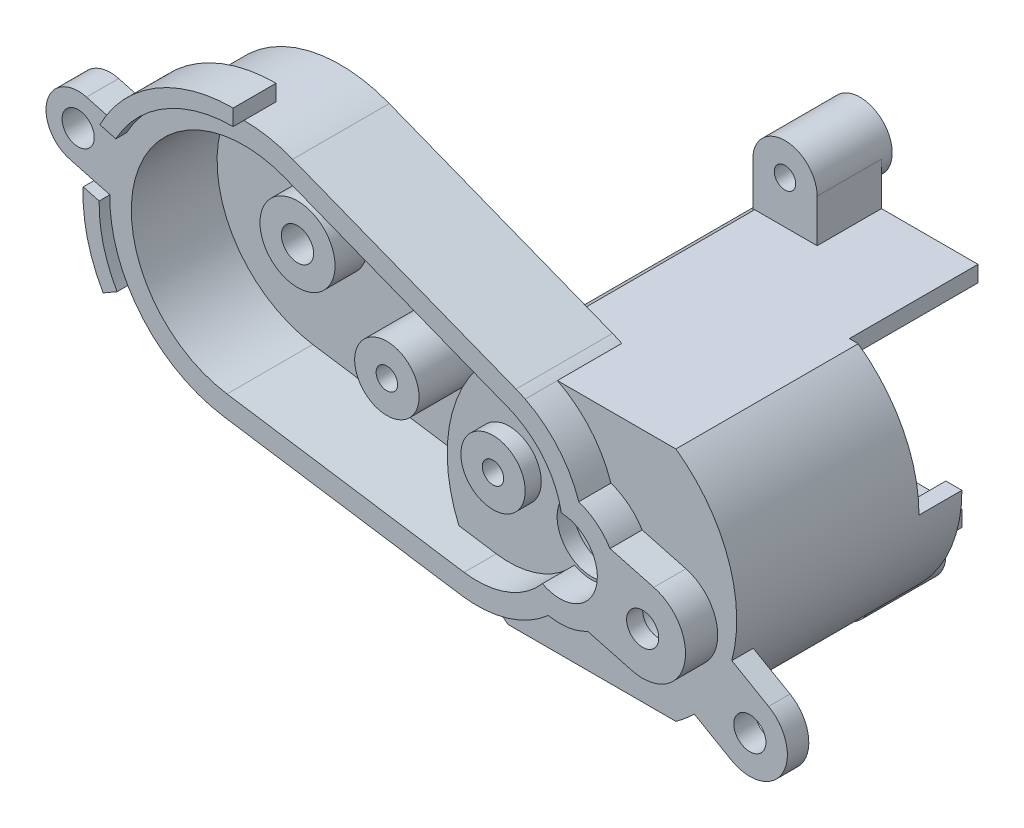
ISO-10303-21;
HEADER;
FILE_DESCRIPTION(('STEP AP214'),'2;1');
FILE_NAME('part.step','',(''),(''),'','','');
FILE_SCHEMA(('AUTOMOTIVE_DESIGN { 1 0 10303 214 1 1 1 1 }'));
ENDSEC;
DATA;
#1=APPLICATION_CONTEXT('core data for automotive mechanical design processes');
#2=APPLICATION_PROTOCOL_DEFINITION('international standard','automotive_design',2000,#1);
#3=PRODUCT_CONTEXT('',#1,'mechanical');
#4=PRODUCT('Part','Part','',(#3));
#5=PRODUCT_RELATED_PRODUCT_CATEGORY('part','',(#4));
#6=PRODUCT_DEFINITION_FORMATION('','',#4);
#7=PRODUCT_DEFINITION_CONTEXT('part definition',#1,'design');
#8=PRODUCT_DEFINITION('design','',#6,#7);
#9=PRODUCT_DEFINITION_SHAPE('','',#8);
#10=(LENGTH_UNIT() NAMED_UNIT(*) SI_UNIT(.MILLI.,.METRE.));
#11=(NAMED_UNIT(*) PLANE_ANGLE_UNIT() SI_UNIT($,.RADIAN.));
#12=(NAMED_UNIT(*) SI_UNIT($,.STERADIAN.) SOLID_ANGLE_UNIT());
#13=UNCERTAINTY_MEASURE_WITH_UNIT(LENGTH_MEASURE(1.E-05),#10,'distance_accuracy_value','');
#14=(GEOMETRIC_REPRESENTATION_CONTEXT(3) GLOBAL_UNCERTAINTY_ASSIGNED_CONTEXT((#13)) GLOBAL_UNIT_ASSIGNED_CONTEXT((#10,
#11,#12)) REPRESENTATION_CONTEXT('',''));
#15=CARTESIAN_POINT('',(0.,0.,0.));
#16=DIRECTION('',(0.,0.,1.));
#17=DIRECTION('',(1.,0.,0.));
#18=AXIS2_PLACEMENT_3D('',#15,#16,#17);
#19=CARTESIAN_POINT('',(-29.4607377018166,7.8939808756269,-5.));
#20=DIRECTION('',(0.,0.,-1.));
#21=DIRECTION('',(-1.,0.,0.));
#22=AXIS2_PLACEMENT_3D('',#19,#20,#21);
#23=CYLINDRICAL_SURFACE('',#22,12.5);
#24=DIRECTION('',(0.,0.,-1.));
#25=VECTOR('',#24,1.);
#26=CARTESIAN_POINT('',(-40.286055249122,1.64398087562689,4.));
#27=LINE('',#26,#25);
#28=CARTESIAN_POINT('',(-40.286055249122,1.64398087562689,3.));
#29=VERTEX_POINT('',#28);
#30=CARTESIAN_POINT('',(-40.286055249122,1.64398087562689,0.));
#31=VERTEX_POINT('',#30);
#32=EDGE_CURVE('E471',#29,#31,#27,.T.);
#33=ORIENTED_EDGE('',*,*,#32,.T.);
#34=CARTESIAN_POINT('',(-29.4607377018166,7.8939808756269,0.));
#35=DIRECTION('',(0.,0.,-1.));
#36=DIRECTION('',(1.,0.,0.));
#37=AXIS2_PLACEMENT_3D('',#34,#35,#36);
#38=CIRCLE('',#37,12.5);
#39=CARTESIAN_POINT('',(-29.4607377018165,20.3939808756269,0.));
#40=VERTEX_POINT('',#39);
#41=EDGE_CURVE('E60',#31,#40,#38,.T.);
#42=ORIENTED_EDGE('',*,*,#41,.T.);
#43=DIRECTION('',(0.,0.,-1.));
#44=VECTOR('',#43,1.);
#45=CARTESIAN_POINT('',(-29.4607377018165,20.3939808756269,4.));
#46=LINE('',#45,#44);
#47=CARTESIAN_POINT('',(-29.4607377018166,20.3939808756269,3.));
#48=VERTEX_POINT('',#47);
#49=EDGE_CURVE('E510',#48,#40,#46,.T.);
#50=ORIENTED_EDGE('',*,*,#49,.F.);
#51=CARTESIAN_POINT('',(-29.4607377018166,7.8939808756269,3.));
#52=DIRECTION('',(0.,0.,1.));
#53=DIRECTION('',(1.,0.,0.));
#54=AXIS2_PLACEMENT_3D('',#51,#52,#53);
#55=CIRCLE('',#54,12.5);
#56=CARTESIAN_POINT('',(-24.903968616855,19.5338200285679,3.));
#57=VERTEX_POINT('',#56);
#58=EDGE_CURVE('E683',#57,#48,#55,.T.);
#59=ORIENTED_EDGE('',*,*,#58,.F.);
#60=DIRECTION('',(0.,0.,-1.));
#61=VECTOR('',#60,1.);
#62=CARTESIAN_POINT('',(-24.903968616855,19.5338200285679,-5.));
#63=LINE('',#62,#61);
#64=CARTESIAN_POINT('',(-24.903968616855,19.5338200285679,-6.00000000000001));
#65=VERTEX_POINT('',#64);
#66=EDGE_CURVE('E739',#57,#65,#63,.T.);
#67=ORIENTED_EDGE('',*,*,#66,.T.);
#68=CARTESIAN_POINT('',(-29.4607377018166,7.8939808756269,-6.));
#69=DIRECTION('',(0.,0.,1.));
#70=DIRECTION('',(1.,0.,0.));
#71=AXIS2_PLACEMENT_3D('',#68,#69,#70);
#72=CIRCLE('',#71,12.5);
#73=CARTESIAN_POINT('',(-31.3343794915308,-4.46480006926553,-6.));
#74=VERTEX_POINT('',#73);
#75=EDGE_CURVE('E726',#65,#74,#72,.T.);
#76=ORIENTED_EDGE('',*,*,#75,.T.);
#77=DIRECTION('',(0.,0.,-1.));
#78=VECTOR('',#77,1.);
#79=CARTESIAN_POINT('',(-31.3343794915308,-4.46480006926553,-5.));
#80=LINE('',#79,#78);
#81=CARTESIAN_POINT('',(-31.3343794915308,-4.46480006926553,3.));
#82=VERTEX_POINT('',#81);
#83=EDGE_CURVE('E736',#82,#74,#80,.T.);
#84=ORIENTED_EDGE('',*,*,#83,.F.);
#85=EDGE_CURVE('E681',#29,#82,#55,.T.);
#86=ORIENTED_EDGE('',*,*,#85,.F.);
#87=EDGE_LOOP('',(#33,#42,#50,#59,#67,#76,#84,#86));
#88=FACE_BOUND('',#87,.T.);
#89=ADVANCED_FACE('F35',(#88),#23,.T.);
#90=CARTESIAN_POINT('',(-45.6920080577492,9.13730811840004,0.));
#91=DIRECTION('',(-0.25881904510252,-0.965925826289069,0.));
#92=DIRECTION('',(0.965925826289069,-0.25881904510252,0.));
#93=AXIS2_PLACEMENT_3D('',#90,#91,#92);
#94=PLANE('',#93);
#95=DIRECTION('',(0.965925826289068,-0.25881904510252,0.));
#96=VECTOR('',#95,1.);
#97=CARTESIAN_POINT('',(-45.6920080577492,9.13730811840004,0.));
#98=LINE('',#97,#96);
#99=CARTESIAN_POINT('',(-45.6920080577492,9.13730811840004,0.));
#100=VERTEX_POINT('',#99);
#101=CARTESIAN_POINT('',(-43.4460318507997,8.53550060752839,0.));
#102=VERTEX_POINT('',#101);
#103=EDGE_CURVE('E535',#100,#102,#98,.T.);
#104=ORIENTED_EDGE('',*,*,#103,.T.);
#105=DIRECTION('',(0.,0.,-1.));
#106=VECTOR('',#105,1.);
#107=CARTESIAN_POINT('',(-43.4460318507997,8.53550060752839,4.));
#108=LINE('',#107,#106);
#109=CARTESIAN_POINT('',(-43.4460318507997,8.53550060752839,3.));
#110=VERTEX_POINT('',#109);
#111=EDGE_CURVE('E477',#110,#102,#108,.T.);
#112=ORIENTED_EDGE('',*,*,#111,.F.);
#113=DIRECTION('',(0.965925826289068,-0.25881904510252,0.));
#114=VECTOR('',#113,1.);
#115=CARTESIAN_POINT('',(-45.6920080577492,9.13730811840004,3.));
#116=LINE('',#115,#114);
#117=CARTESIAN_POINT('',(-45.6920080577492,9.13730811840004,3.));
#118=VERTEX_POINT('',#117);
#119=EDGE_CURVE('E525',#118,#110,#116,.T.);
#120=ORIENTED_EDGE('',*,*,#119,.F.);
#121=DIRECTION('',(0.,0.,1.));
#122=VECTOR('',#121,1.);
#123=CARTESIAN_POINT('',(-45.6920080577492,9.13730811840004,0.));
#124=LINE('',#123,#122);
#125=EDGE_CURVE('E540',#100,#118,#124,.T.);
#126=ORIENTED_EDGE('',*,*,#125,.F.);
#127=EDGE_LOOP('',(#104,#112,#120,#126));
#128=FACE_BOUND('',#127,.T.);
#129=ADVANCED_FACE('F815',(#128),#94,.T.);
#130=CARTESIAN_POINT('',(-40.4054631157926,13.9324397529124,0.));
#131=DIRECTION('',(0.258819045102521,0.965925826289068,0.));
#132=DIRECTION('',(-0.965925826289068,0.258819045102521,0.));
#133=AXIS2_PLACEMENT_3D('',#130,#131,#132);
#134=PLANE('',#133);
#135=DIRECTION('',(-0.965925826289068,0.258819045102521,0.));
#136=VECTOR('',#135,1.);
#137=CARTESIAN_POINT('',(-40.4054631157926,13.9324397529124,3.));
#138=LINE('',#137,#136);
#139=CARTESIAN_POINT('',(-41.8931175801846,14.3310555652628,3.));
#140=VERTEX_POINT('',#139);
#141=CARTESIAN_POINT('',(-44.1390937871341,14.9328630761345,3.));
#142=VERTEX_POINT('',#141);
#143=EDGE_CURVE('E528',#140,#142,#138,.T.);
#144=ORIENTED_EDGE('',*,*,#143,.F.);
#145=DIRECTION('',(0.,0.,-1.));
#146=VECTOR('',#145,1.);
#147=CARTESIAN_POINT('',(-41.8931175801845,14.3310555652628,4.));
#148=LINE('',#147,#146);
#149=CARTESIAN_POINT('',(-41.8931175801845,14.3310555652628,0.));
#150=VERTEX_POINT('',#149);
#151=EDGE_CURVE('E504',#140,#150,#148,.T.);
#152=ORIENTED_EDGE('',*,*,#151,.T.);
#153=DIRECTION('',(-0.965925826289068,0.258819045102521,0.));
#154=VECTOR('',#153,1.);
#155=CARTESIAN_POINT('',(-40.4054631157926,13.9324397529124,0.));
#156=LINE('',#155,#154);
#157=CARTESIAN_POINT('',(-44.1390937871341,14.9328630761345,0.));
#158=VERTEX_POINT('',#157);
#159=EDGE_CURVE('E538',#150,#158,#156,.T.);
#160=ORIENTED_EDGE('',*,*,#159,.T.);
#161=DIRECTION('',(0.,0.,1.));
#162=VECTOR('',#161,1.);
#163=CARTESIAN_POINT('',(-44.1390937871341,14.9328630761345,0.));
#164=LINE('',#163,#162);
#165=EDGE_CURVE('E541',#158,#142,#164,.T.);
#166=ORIENTED_EDGE('',*,*,#165,.T.);
#167=EDGE_LOOP('',(#144,#152,#160,#166));
#168=FACE_BOUND('',#167,.T.);
#169=ADVANCED_FACE('F821',(#168),#134,.T.);
#170=CARTESIAN_POINT('',(7.72740661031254,-2.07055236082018,-30.));
#171=DIRECTION('',(0.,0.,1.));
#172=DIRECTION('',(1.,0.,0.));
#173=AXIS2_PLACEMENT_3D('',#170,#171,#172);
#174=CYLINDRICAL_SURFACE('',#173,1.5);
#175=CARTESIAN_POINT('',(7.72740661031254,-2.07055236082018,3.));
#176=DIRECTION('',(0.,0.,1.));
#177=DIRECTION('',(1.,0.,0.));
#178=AXIS2_PLACEMENT_3D('',#175,#176,#177);
#179=CIRCLE('',#178,1.5);
#180=CARTESIAN_POINT('',(9.22740661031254,-2.07055236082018,3.));
#181=VERTEX_POINT('',#180);
#182=EDGE_CURVE('E551',#181,#181,#179,.T.);
#183=ORIENTED_EDGE('',*,*,#182,.T.);
#184=EDGE_LOOP('',(#183));
#185=FACE_BOUND('',#184,.T.);
#186=CARTESIAN_POINT('',(7.72740661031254,-2.07055236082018,1.5));
#187=DIRECTION('',(0.,0.,-1.));
#188=DIRECTION('',(-1.,0.,0.));
#189=AXIS2_PLACEMENT_3D('',#186,#187,#188);
#190=CIRCLE('',#189,1.5);
#191=CARTESIAN_POINT('',(6.22740661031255,-2.07055236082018,1.5));
#192=VERTEX_POINT('',#191);
#193=EDGE_CURVE('E39',#192,#192,#190,.F.);
#194=ORIENTED_EDGE('',*,*,#193,.F.);
#195=EDGE_LOOP('',(#194));
#196=FACE_BOUND('',#195,.T.);
#197=ADVANCED_FACE('F1218',(#185,#196),#174,.F.);
#198=CARTESIAN_POINT('',(0.,0.,-500000.));
#199=DIRECTION('',(0.,0.,1.));
#200=DIRECTION('',(1.,0.,0.));
#201=AXIS2_PLACEMENT_3D('',#198,#199,#200);
#202=CYLINDRICAL_SURFACE('',#201,5.5);
#203=DIRECTION('',(0.,0.,1.));
#204=VECTOR('',#203,1.);
#205=CARTESIAN_POINT('',(2.61101385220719,-4.84072377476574,-12.7804804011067));
#206=LINE('',#205,#204);
#207=CARTESIAN_POINT('',(2.61101385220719,-4.84072377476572,0.));
#208=VERTEX_POINT('',#207);
#209=CARTESIAN_POINT('',(2.61101385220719,-4.84072377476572,3.));
#210=VERTEX_POINT('',#209);
#211=EDGE_CURVE('E571',#208,#210,#206,.T.);
#212=ORIENTED_EDGE('',*,*,#211,.T.);
#213=CARTESIAN_POINT('',(0.,0.,3.));
#214=DIRECTION('',(0.,0.,1.));
#215=DIRECTION('',(1.,0.,0.));
#216=AXIS2_PLACEMENT_3D('',#213,#214,#215);
#217=CIRCLE('',#216,5.5);
#218=CARTESIAN_POINT('',(-1.07333312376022,-5.39425212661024,3.));
#219=VERTEX_POINT('',#218);
#220=EDGE_CURVE('E677',#219,#210,#217,.T.);
#221=ORIENTED_EDGE('',*,*,#220,.F.);
#222=DIRECTION('',(0.,0.,1.));
#223=VECTOR('',#222,1.);
#224=CARTESIAN_POINT('',(-1.07333312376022,-5.39425212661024,-500000.));
#225=LINE('',#224,#223);
#226=CARTESIAN_POINT('',(-1.07333312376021,-5.39425212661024,0.));
#227=VERTEX_POINT('',#226);
#228=EDGE_CURVE('E702',#227,#219,#225,.T.);
#229=ORIENTED_EDGE('',*,*,#228,.F.);
#230=CARTESIAN_POINT('',(0.,0.,0.));
#231=DIRECTION('',(0.,0.,1.));
#232=DIRECTION('',(1.,0.,0.));
#233=AXIS2_PLACEMENT_3D('',#230,#231,#232);
#234=CIRCLE('',#233,5.5);
#235=EDGE_CURVE('E712',#208,#227,#234,.F.);
#236=ORIENTED_EDGE('',*,*,#235,.F.);
#237=EDGE_LOOP('',(#212,#221,#229,#236));
#238=FACE_BOUND('',#237,.T.);
#239=ADVANCED_FACE('F1137',(#238),#202,.T.);
#240=CARTESIAN_POINT('',(0.,0.,-6.));
#241=DIRECTION('',(0.,0.,1.));
#242=DIRECTION('',(1.,0.,0.));
#243=AXIS2_PLACEMENT_3D('',#240,#241,#242);
#244=PLANE('',#243);
#245=CARTESIAN_POINT('',(0.,0.,-6.));
#246=DIRECTION('',(0.,0.,-1.));
#247=DIRECTION('',(1.,0.,0.));
#248=AXIS2_PLACEMENT_3D('',#245,#246,#247);
#249=CIRCLE('',#248,13.5);
#250=CARTESIAN_POINT('',(-11.2149426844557,-7.51498906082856,-6.));
#251=VERTEX_POINT('',#250);
#252=CARTESIAN_POINT('',(-7.82623792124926,11.,-6.));
#253=VERTEX_POINT('',#252);
#254=EDGE_CURVE('E676',#251,#253,#249,.T.);
#255=ORIENTED_EDGE('',*,*,#254,.F.);
#256=DIRECTION('',(0.988702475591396,-0.149891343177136,0.));
#257=VECTOR('',#256,1.);
#258=CARTESIAN_POINT('',(-31.3343794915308,-4.46480006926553,-6.));
#259=LINE('',#258,#257);
#260=EDGE_CURVE('E728',#74,#251,#259,.T.);
#261=ORIENTED_EDGE('',*,*,#260,.F.);
#262=ORIENTED_EDGE('',*,*,#75,.F.);
#263=DIRECTION('',(-0.93118713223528,0.364541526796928,0.));
#264=VECTOR('',#263,1.);
#265=CARTESIAN_POINT('',(-24.903968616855,19.5338200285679,-6.00000000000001));
#266=LINE('',#265,#264);
#267=CARTESIAN_POINT('',(-4.08199134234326,11.382423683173,-6.));
#268=VERTEX_POINT('',#267);
#269=EDGE_CURVE('E724',#268,#65,#266,.T.);
#270=ORIENTED_EDGE('',*,*,#269,.F.);
#271=CARTESIAN_POINT('',(-7.72740661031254,2.07055236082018,-6.));
#272=DIRECTION('',(0.,0.,1.));
#273=DIRECTION('',(1.,0.,0.));
#274=AXIS2_PLACEMENT_3D('',#271,#272,#273);
#275=CIRCLE('',#274,10.);
#276=CARTESIAN_POINT('',(-3.22574415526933,11.,-6.00000000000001));
#277=VERTEX_POINT('',#276);
#278=EDGE_CURVE('E722',#277,#268,#275,.T.);
#279=ORIENTED_EDGE('',*,*,#278,.F.);
#280=DIRECTION('',(1.,0.,0.));
#281=VECTOR('',#280,1.);
#282=CARTESIAN_POINT('',(-3.22574415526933,11.,-6.));
#283=LINE('',#282,#281);
#284=EDGE_CURVE('E719',#253,#277,#283,.T.);
#285=ORIENTED_EDGE('',*,*,#284,.F.);
#286=EDGE_LOOP('',(#255,#261,#262,#270,#279,#285));
#287=FACE_BOUND('',#286,.T.);
#288=CARTESIAN_POINT('',(-29.4607377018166,7.8939808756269,-6.));
#289=DIRECTION('',(0.,0.,1.));
#290=DIRECTION('',(1.,0.,0.));
#291=AXIS2_PLACEMENT_3D('',#288,#289,#290);
#292=CIRCLE('',#291,3.5);
#293=CARTESIAN_POINT('',(-25.9607377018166,7.8939808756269,-6.));
#294=VERTEX_POINT('',#293);
#295=EDGE_CURVE('E11',#294,#294,#292,.F.);
#296=ORIENTED_EDGE('',*,*,#295,.F.);
#297=EDGE_LOOP('',(#296));
#298=FACE_BOUND('',#297,.T.);
#299=ADVANCED_FACE('F942',(#287,#298),#244,.F.);
#300=CARTESIAN_POINT('',(0.,0.,-5.));
#301=DIRECTION('',(0.,0.,1.));
#302=DIRECTION('',(1.,0.,0.));
#303=AXIS2_PLACEMENT_3D('',#300,#301,#302);
#304=PLANE('',#303);
#305=CARTESIAN_POINT('',(0.,0.,-5.));
#306=DIRECTION('',(0.,0.,-1.));
#307=DIRECTION('',(1.,0.,0.));
#308=AXIS2_PLACEMENT_3D('',#305,#306,#307);
#309=CIRCLE('',#308,13.5);
#310=CARTESIAN_POINT('',(-12.411533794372,-5.31072771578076,-5.));
#311=VERTEX_POINT('',#310);
#312=CARTESIAN_POINT('',(-8.0933397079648,10.8049920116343,-5.00000000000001));
#313=VERTEX_POINT('',#312);
#314=EDGE_CURVE('E730',#311,#313,#309,.T.);
#315=ORIENTED_EDGE('',*,*,#314,.T.);
#316=DIRECTION('',(0.93118713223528,-0.364541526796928,0.));
#317=VECTOR('',#316,1.);
#318=CARTESIAN_POINT('',(-4.81107439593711,9.52004941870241,-4.99999999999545));
#319=LINE('',#318,#317);
#320=CARTESIAN_POINT('',(-25.6330516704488,17.6714457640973,-4.99999999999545));
#321=VERTEX_POINT('',#320);
#322=EDGE_CURVE('E619',#321,#313,#319,.T.);
#323=ORIENTED_EDGE('',*,*,#322,.F.);
#324=CARTESIAN_POINT('',(-29.4607377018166,7.8939808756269,-4.99999999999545));
#325=DIRECTION('',(0.,0.,1.));
#326=DIRECTION('',(1.,0.,0.));
#327=AXIS2_PLACEMENT_3D('',#324,#325,#326);
#328=CIRCLE('',#327,10.5);
#329=CARTESIAN_POINT('',(-31.0345968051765,-2.48739511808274,-4.99999999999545));
#330=VERTEX_POINT('',#329);
#331=EDGE_CURVE('E618',#330,#321,#328,.F.);
#332=ORIENTED_EDGE('',*,*,#331,.F.);
#333=DIRECTION('',(-0.988702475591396,0.149891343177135,0.));
#334=VECTOR('',#333,1.);
#335=CARTESIAN_POINT('',(-8.92653735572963,-5.839067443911,-4.99999999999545));
#336=LINE('',#335,#334);
#337=EDGE_CURVE('E670',#311,#330,#336,.T.);
#338=ORIENTED_EDGE('',*,*,#337,.F.);
#339=EDGE_LOOP('',(#315,#323,#332,#338));
#340=FACE_BOUND('',#339,.T.);
#341=CARTESIAN_POINT('',(-17.6281463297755,4.72344757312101,-4.99999999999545));
#342=DIRECTION('',(0.,0.,1.));
#343=DIRECTION('',(1.,0.,0.));
#344=AXIS2_PLACEMENT_3D('',#341,#342,#343);
#345=CIRCLE('',#344,3.);
#346=CARTESIAN_POINT('',(-14.6281463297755,4.72344757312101,-4.99999999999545));
#347=VERTEX_POINT('',#346);
#348=EDGE_CURVE('E44',#347,#347,#345,.T.);
#349=ORIENTED_EDGE('',*,*,#348,.F.);
#350=EDGE_LOOP('',(#349));
#351=FACE_BOUND('',#350,.T.);
#352=CARTESIAN_POINT('',(-29.4607377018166,7.8939808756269,-5.));
#353=DIRECTION('',(0.,0.,1.));
#354=DIRECTION('',(1.,0.,0.));
#355=AXIS2_PLACEMENT_3D('',#352,#353,#354);
#356=CIRCLE('',#355,3.5);
#357=CARTESIAN_POINT('',(-25.9607377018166,7.8939808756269,-5.));
#358=VERTEX_POINT('',#357);
#359=EDGE_CURVE('E589',#358,#358,#356,.F.);
#360=ORIENTED_EDGE('',*,*,#359,.T.);
#361=EDGE_LOOP('',(#360));
#362=FACE_BOUND('',#361,.T.);
#363=ADVANCED_FACE('F934',(#340,#351,#362),#304,.T.);
#364=CARTESIAN_POINT('',(0.,0.,-29.));
#365=DIRECTION('',(0.,0.,1.));
#366=DIRECTION('',(1.,0.,0.));
#367=AXIS2_PLACEMENT_3D('',#364,#365,#366);
#368=PLANE('',#367);
#369=CARTESIAN_POINT('',(-5.,15.,-29.));
#370=DIRECTION('',(0.,0.,-1.));
#371=DIRECTION('',(-1.,0.,0.));
#372=AXIS2_PLACEMENT_3D('',#369,#370,#371);
#373=CIRCLE('',#372,3.);
#374=CARTESIAN_POINT('',(-1.99999999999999,15.,-29.));
#375=VERTEX_POINT('',#374);
#376=CARTESIAN_POINT('',(-8.00000000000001,15.,-29.));
#377=VERTEX_POINT('',#376);
#378=EDGE_CURVE('E751',#375,#377,#373,.T.);
#379=ORIENTED_EDGE('',*,*,#378,.F.);
#380=DIRECTION('',(0.,-1.,0.));
#381=VECTOR('',#380,1.);
#382=CARTESIAN_POINT('',(-1.99999999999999,15.,-29.));
#383=LINE('',#382,#381);
#384=CARTESIAN_POINT('',(-1.99999999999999,11.,-29.));
#385=VERTEX_POINT('',#384);
#386=EDGE_CURVE('E948',#375,#385,#383,.T.);
#387=ORIENTED_EDGE('',*,*,#386,.T.);
#388=DIRECTION('',(-1.,0.,0.));
#389=VECTOR('',#388,1.);
#390=CARTESIAN_POINT('',(7.82623792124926,11.,-29.));
#391=LINE('',#390,#389);
#392=CARTESIAN_POINT('',(7.,11.,-29.));
#393=VERTEX_POINT('',#392);
#394=EDGE_CURVE('E1010',#393,#385,#391,.T.);
#395=ORIENTED_EDGE('',*,*,#394,.F.);
#396=DIRECTION('',(0.,1.,0.));
#397=VECTOR('',#396,1.);
#398=CARTESIAN_POINT('',(7.,0.,-29.));
#399=LINE('',#398,#397);
#400=CARTESIAN_POINT('',(7.,9.50000000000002,-29.));
#401=VERTEX_POINT('',#400);
#402=EDGE_CURVE('E1994',#401,#393,#399,.T.);
#403=ORIENTED_EDGE('',*,*,#402,.F.);
#404=DIRECTION('',(-1.,0.,0.));
#405=VECTOR('',#404,1.);
#406=CARTESIAN_POINT('',(0.,9.50000000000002,-29.));
#407=LINE('',#406,#405);
#408=CARTESIAN_POINT('',(-7.33143914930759,9.50000000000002,-29.));
#409=VERTEX_POINT('',#408);
#410=EDGE_CURVE('E1058',#401,#409,#407,.T.);
#411=ORIENTED_EDGE('',*,*,#410,.T.);
#412=CARTESIAN_POINT('',(0.,0.,-29.));
#413=DIRECTION('',(0.,0.,1.));
#414=DIRECTION('',(1.,0.,0.));
#415=AXIS2_PLACEMENT_3D('',#412,#413,#414);
#416=CIRCLE('',#415,12.);
#417=CARTESIAN_POINT('',(-7.33143914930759,-9.50000000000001,-29.));
#418=VERTEX_POINT('',#417);
#419=EDGE_CURVE('E1056',#409,#418,#416,.T.);
#420=ORIENTED_EDGE('',*,*,#419,.T.);
#421=DIRECTION('',(1.,0.,0.));
#422=VECTOR('',#421,1.);
#423=CARTESIAN_POINT('',(0.,-9.50000000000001,-29.));
#424=LINE('',#423,#422);
#425=CARTESIAN_POINT('',(5.5,-9.50000000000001,-29.));
#426=VERTEX_POINT('',#425);
#427=EDGE_CURVE('E1049',#418,#426,#424,.T.);
#428=ORIENTED_EDGE('',*,*,#427,.T.);
#429=DIRECTION('',(0.,1.,0.));
#430=VECTOR('',#429,1.);
#431=CARTESIAN_POINT('',(5.5,-11.,-29.));
#432=LINE('',#431,#430);
#433=CARTESIAN_POINT('',(5.5,-11.,-29.));
#434=VERTEX_POINT('',#433);
#435=EDGE_CURVE('E783',#434,#426,#432,.T.);
#436=ORIENTED_EDGE('',*,*,#435,.F.);
#437=DIRECTION('',(1.,0.,0.));
#438=VECTOR('',#437,1.);
#439=CARTESIAN_POINT('',(7.82623792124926,-11.,-29.));
#440=LINE('',#439,#438);
#441=CARTESIAN_POINT('',(3.,-11.,-29.));
#442=VERTEX_POINT('',#441);
#443=EDGE_CURVE('E1006',#442,#434,#440,.T.);
#444=ORIENTED_EDGE('',*,*,#443,.F.);
#445=DIRECTION('',(0.,-1.,0.));
#446=VECTOR('',#445,1.);
#447=CARTESIAN_POINT('',(3.,-15.,-29.));
#448=LINE('',#447,#446);
#449=CARTESIAN_POINT('',(3.,-15.,-29.));
#450=VERTEX_POINT('',#449);
#451=EDGE_CURVE('E980',#442,#450,#448,.T.);
#452=ORIENTED_EDGE('',*,*,#451,.T.);
#453=CARTESIAN_POINT('',(0.,-15.,-29.));
#454=DIRECTION('',(0.,0.,-1.));
#455=DIRECTION('',(-1.,0.,0.));
#456=AXIS2_PLACEMENT_3D('',#453,#454,#455);
#457=CIRCLE('',#456,3.);
#458=CARTESIAN_POINT('',(-3.,-15.,-29.));
#459=VERTEX_POINT('',#458);
#460=EDGE_CURVE('E760',#459,#450,#457,.T.);
#461=ORIENTED_EDGE('',*,*,#460,.F.);
#462=DIRECTION('',(0.,1.,0.));
#463=VECTOR('',#462,1.);
#464=CARTESIAN_POINT('',(-3.,-15.,-29.));
#465=LINE('',#464,#463);
#466=CARTESIAN_POINT('',(-3.,-10.9999999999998,-29.));
#467=VERTEX_POINT('',#466);
#468=EDGE_CURVE('E975',#459,#467,#465,.T.);
#469=ORIENTED_EDGE('',*,*,#468,.T.);
#470=CARTESIAN_POINT('',(-7.82623792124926,-11.,-29.));
#471=VERTEX_POINT('',#470);
#472=EDGE_CURVE('E1009',#471,#467,#440,.T.);
#473=ORIENTED_EDGE('',*,*,#472,.F.);
#474=CARTESIAN_POINT('',(0.,0.,-29.));
#475=DIRECTION('',(0.,0.,1.));
#476=DIRECTION('',(1.,0.,0.));
#477=AXIS2_PLACEMENT_3D('',#474,#475,#476);
#478=CIRCLE('',#477,13.5);
#479=CARTESIAN_POINT('',(-8.00000000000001,10.8742815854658,-29.));
#480=VERTEX_POINT('',#479);
#481=EDGE_CURVE('E1033',#480,#471,#478,.T.);
#482=ORIENTED_EDGE('',*,*,#481,.F.);
#483=DIRECTION('',(0.,1.,0.));
#484=VECTOR('',#483,1.);
#485=CARTESIAN_POINT('',(-8.00000000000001,15.,-29.));
#486=LINE('',#485,#484);
#487=EDGE_CURVE('E951',#480,#377,#486,.T.);
#488=ORIENTED_EDGE('',*,*,#487,.T.);
#489=EDGE_LOOP('',(#379,#387,#395,#403,#411,#420,#428,#436,#444,#452,#461,#469,#473,#482,#488));
#490=FACE_BOUND('',#489,.T.);
#491=ADVANCED_FACE('F932',(#490),#368,.F.);
#492=CARTESIAN_POINT('',(0.,0.,-29.));
#493=DIRECTION('',(0.,0.,1.));
#494=DIRECTION('',(1.,0.,0.));
#495=AXIS2_PLACEMENT_3D('',#492,#493,#494);
#496=CYLINDRICAL_SURFACE('',#495,13.5);
#497=DIRECTION('',(0.,0.,1.));
#498=VECTOR('',#497,1.);
#499=CARTESIAN_POINT('',(9.54158979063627,-9.55029131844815,-2.));
#500=LINE('',#499,#498);
#501=CARTESIAN_POINT('',(9.54158979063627,-9.55029131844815,-2.));
#502=VERTEX_POINT('',#501);
#503=CARTESIAN_POINT('',(9.54158979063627,-9.55029131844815,0.));
#504=VERTEX_POINT('',#503);
#505=EDGE_CURVE('E453',#502,#504,#500,.T.);
#506=ORIENTED_EDGE('',*,*,#505,.T.);
#507=CARTESIAN_POINT('',(0.,0.,0.));
#508=DIRECTION('',(0.,0.,1.));
#509=DIRECTION('',(1.,0.,0.));
#510=AXIS2_PLACEMENT_3D('',#507,#508,#509);
#511=CIRCLE('',#510,13.5);
#512=CARTESIAN_POINT('',(7.82623792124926,-11.,0.));
#513=VERTEX_POINT('',#512);
#514=EDGE_CURVE('E1029',#513,#504,#511,.T.);
#515=ORIENTED_EDGE('',*,*,#514,.F.);
#516=DIRECTION('',(0.,0.,1.));
#517=VECTOR('',#516,1.);
#518=CARTESIAN_POINT('',(7.82623792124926,-11.,-29.));
#519=LINE('',#518,#517);
#520=CARTESIAN_POINT('',(7.82623792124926,-11.,-21.));
#521=VERTEX_POINT('',#520);
#522=EDGE_CURVE('E1016',#521,#513,#519,.T.);
#523=ORIENTED_EDGE('',*,*,#522,.F.);
#524=CARTESIAN_POINT('',(0.,0.,-21.));
#525=DIRECTION('',(0.,0.,-1.));
#526=DIRECTION('',(-1.,0.,0.));
#527=AXIS2_PLACEMENT_3D('',#524,#525,#526);
#528=CIRCLE('',#527,13.5);
#529=CARTESIAN_POINT('',(13.5,0.,-21.));
#530=VERTEX_POINT('',#529);
#531=EDGE_CURVE('E2002',#530,#521,#528,.T.);
#532=ORIENTED_EDGE('',*,*,#531,.F.);
#533=DIRECTION('',(0.,0.,-1.));
#534=VECTOR('',#533,1.);
#535=CARTESIAN_POINT('',(13.5,0.,-17.));
#536=LINE('',#535,#534);
#537=CARTESIAN_POINT('',(13.5,0.,-17.));
#538=VERTEX_POINT('',#537);
#539=EDGE_CURVE('E1980',#538,#530,#536,.T.);
#540=ORIENTED_EDGE('',*,*,#539,.F.);
#541=CARTESIAN_POINT('',(0.,0.,-17.));
#542=DIRECTION('',(0.,0.,-1.));
#543=DIRECTION('',(-1.,0.,0.));
#544=AXIS2_PLACEMENT_3D('',#541,#542,#543);
#545=CIRCLE('',#544,13.5);
#546=CARTESIAN_POINT('',(7.82623792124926,11.,-17.));
#547=VERTEX_POINT('',#546);
#548=EDGE_CURVE('E1991',#547,#538,#545,.T.);
#549=ORIENTED_EDGE('',*,*,#548,.F.);
#550=DIRECTION('',(0.,0.,1.));
#551=VECTOR('',#550,1.);
#552=CARTESIAN_POINT('',(7.82623792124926,11.,-29.));
#553=LINE('',#552,#551);
#554=CARTESIAN_POINT('',(7.82623792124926,11.,0.));
#555=VERTEX_POINT('',#554);
#556=EDGE_CURVE('E1026',#547,#555,#553,.T.);
#557=ORIENTED_EDGE('',*,*,#556,.T.);
#558=CARTESIAN_POINT('',(13.0415897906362,-3.48811349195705,0.));
#559=VERTEX_POINT('',#558);
#560=EDGE_CURVE('E1019',#559,#555,#511,.T.);
#561=ORIENTED_EDGE('',*,*,#560,.F.);
#562=DIRECTION('',(0.,0.,1.));
#563=VECTOR('',#562,1.);
#564=CARTESIAN_POINT('',(13.0415897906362,-3.48811349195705,-2.));
#565=LINE('',#564,#563);
#566=CARTESIAN_POINT('',(13.0415897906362,-3.48811349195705,-2.));
#567=VERTEX_POINT('',#566);
#568=EDGE_CURVE('E422',#567,#559,#565,.T.);
#569=ORIENTED_EDGE('',*,*,#568,.F.);
#570=CARTESIAN_POINT('',(0.,0.,-2.));
#571=DIRECTION('',(0.,0.,-1.));
#572=DIRECTION('',(1.,0.,0.));
#573=AXIS2_PLACEMENT_3D('',#570,#571,#572);
#574=CIRCLE('',#573,13.5);
#575=EDGE_CURVE('E445',#567,#502,#574,.T.);
#576=ORIENTED_EDGE('',*,*,#575,.T.);
#577=EDGE_LOOP('',(#506,#515,#523,#532,#540,#549,#557,#561,#569,#576));
#578=FACE_BOUND('',#577,.T.);
#579=ADVANCED_FACE('F37',(#578),#496,.T.);
#580=CARTESIAN_POINT('',(0.,0.,-29.));
#581=DIRECTION('',(0.,0.,1.));
#582=DIRECTION('',(1.,0.,0.));
#583=AXIS2_PLACEMENT_3D('',#580,#581,#582);
#584=CYLINDRICAL_SURFACE('',#583,12.);
#585=CARTESIAN_POINT('',(0.,0.,-21.));
#586=DIRECTION('',(0.,0.,-1.));
#587=DIRECTION('',(-1.,0.,0.));
#588=AXIS2_PLACEMENT_3D('',#585,#586,#587);
#589=CIRCLE('',#588,12.);
#590=CARTESIAN_POINT('',(7.33143914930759,-9.50000000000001,-21.));
#591=VERTEX_POINT('',#590);
#592=CARTESIAN_POINT('',(12.,0.,-21.));
#593=VERTEX_POINT('',#592);
#594=EDGE_CURVE('E1996',#591,#593,#589,.F.);
#595=ORIENTED_EDGE('',*,*,#594,.F.);
#596=DIRECTION('',(0.,0.,1.));
#597=VECTOR('',#596,1.);
#598=CARTESIAN_POINT('',(7.33143914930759,-9.50000000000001,-29.));
#599=LINE('',#598,#597);
#600=CARTESIAN_POINT('',(7.33143914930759,-9.50000000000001,-1.5));
#601=VERTEX_POINT('',#600);
#602=EDGE_CURVE('E1968',#591,#601,#599,.T.);
#603=ORIENTED_EDGE('',*,*,#602,.T.);
#604=CARTESIAN_POINT('',(0.,0.,-1.5));
#605=DIRECTION('',(0.,0.,1.));
#606=DIRECTION('',(1.,0.,0.));
#607=AXIS2_PLACEMENT_3D('',#604,#605,#606);
#608=CIRCLE('',#607,12.);
#609=CARTESIAN_POINT('',(7.33143914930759,9.49999999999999,-1.5));
#610=VERTEX_POINT('',#609);
#611=EDGE_CURVE('E1969',#601,#610,#608,.T.);
#612=ORIENTED_EDGE('',*,*,#611,.T.);
#613=DIRECTION('',(0.,0.,1.));
#614=VECTOR('',#613,1.);
#615=CARTESIAN_POINT('',(7.33143914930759,9.50000000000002,-29.));
#616=LINE('',#615,#614);
#617=CARTESIAN_POINT('',(7.33143914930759,9.49999999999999,-17.));
#618=VERTEX_POINT('',#617);
#619=EDGE_CURVE('E1057',#618,#610,#616,.T.);
#620=ORIENTED_EDGE('',*,*,#619,.F.);
#621=CARTESIAN_POINT('',(0.,0.,-17.));
#622=DIRECTION('',(0.,0.,-1.));
#623=DIRECTION('',(-1.,0.,0.));
#624=AXIS2_PLACEMENT_3D('',#621,#622,#623);
#625=CIRCLE('',#624,12.);
#626=CARTESIAN_POINT('',(12.,0.,-17.));
#627=VERTEX_POINT('',#626);
#628=EDGE_CURVE('E1974',#627,#618,#625,.F.);
#629=ORIENTED_EDGE('',*,*,#628,.F.);
#630=DIRECTION('',(0.,0.,1.));
#631=VECTOR('',#630,1.);
#632=CARTESIAN_POINT('',(12.,0.,-29.));
#633=LINE('',#632,#631);
#634=EDGE_CURVE('E1040',#627,#593,#633,.F.);
#635=ORIENTED_EDGE('',*,*,#634,.T.);
#636=EDGE_LOOP('',(#595,#603,#612,#620,#629,#635));
#637=FACE_BOUND('',#636,.T.);
#638=ADVANCED_FACE('F905',(#637),#584,.F.);
#639=CARTESIAN_POINT('',(13.5,0.,-17.));
#640=DIRECTION('',(0.,-1.,0.));
#641=DIRECTION('',(0.,0.,-1.));
#642=AXIS2_PLACEMENT_3D('',#639,#640,#641);
#643=PLANE('',#642);
#644=DIRECTION('',(1.,0.,0.));
#645=VECTOR('',#644,1.);
#646=CARTESIAN_POINT('',(13.5,0.,-21.));
#647=LINE('',#646,#645);
#648=EDGE_CURVE('E1043',#593,#530,#647,.T.);
#649=ORIENTED_EDGE('',*,*,#648,.F.);
#650=ORIENTED_EDGE('',*,*,#634,.F.);
#651=DIRECTION('',(-1.,0.,0.));
#652=VECTOR('',#651,1.);
#653=CARTESIAN_POINT('',(13.5,0.,-17.));
#654=LINE('',#653,#652);
#655=EDGE_CURVE('E1988',#538,#627,#654,.T.);
#656=ORIENTED_EDGE('',*,*,#655,.F.);
#657=ORIENTED_EDGE('',*,*,#539,.T.);
#658=EDGE_LOOP('',(#649,#650,#656,#657));
#659=FACE_BOUND('',#658,.T.);
#660=ADVANCED_FACE('F901',(#659),#643,.F.);
#661=CARTESIAN_POINT('',(-11.2149426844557,-7.51498906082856,0.));
#662=VERTEX_POINT('',#661);
#663=CARTESIAN_POINT('',(-7.82623792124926,-11.,0.));
#664=VERTEX_POINT('',#663);
#665=EDGE_CURVE('E1031',#662,#664,#511,.T.);
#666=ORIENTED_EDGE('',*,*,#665,.F.);
#667=DIRECTION('',(0.,0.,-1.));
#668=VECTOR('',#667,1.);
#669=CARTESIAN_POINT('',(-11.2149426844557,-7.51498906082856,-5.));
#670=LINE('',#669,#668);
#671=EDGE_CURVE('E733',#662,#251,#670,.T.);
#672=ORIENTED_EDGE('',*,*,#671,.T.);
#673=ORIENTED_EDGE('',*,*,#254,.T.);
#674=DIRECTION('',(0.,0.,1.));
#675=VECTOR('',#674,1.);
#676=CARTESIAN_POINT('',(-7.82623792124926,11.,-29.));
#677=LINE('',#676,#675);
#678=CARTESIAN_POINT('',(-7.82623792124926,11.,-23.));
#679=VERTEX_POINT('',#678);
#680=EDGE_CURVE('E1023',#679,#253,#677,.T.);
#681=ORIENTED_EDGE('',*,*,#680,.F.);
#682=CARTESIAN_POINT('',(0.,0.,-23.));
#683=DIRECTION('',(0.,0.,1.));
#684=DIRECTION('',(-1.,0.,0.));
#685=AXIS2_PLACEMENT_3D('',#682,#683,#684);
#686=CIRCLE('',#685,13.5);
#687=CARTESIAN_POINT('',(-8.00000000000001,10.8742815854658,-23.));
#688=VERTEX_POINT('',#687);
#689=EDGE_CURVE('E968',#679,#688,#686,.T.);
#690=ORIENTED_EDGE('',*,*,#689,.T.);
#691=DIRECTION('',(0.,0.,-1.));
#692=VECTOR('',#691,1.);
#693=CARTESIAN_POINT('',(-8.00000000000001,10.8742815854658,-23.));
#694=LINE('',#693,#692);
#695=EDGE_CURVE('E965',#688,#480,#694,.T.);
#696=ORIENTED_EDGE('',*,*,#695,.T.);
#697=ORIENTED_EDGE('',*,*,#481,.T.);
#698=DIRECTION('',(0.,0.,1.));
#699=VECTOR('',#698,1.);
#700=CARTESIAN_POINT('',(-7.82623792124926,-11.,-29.));
#701=LINE('',#700,#699);
#702=EDGE_CURVE('E1020',#471,#664,#701,.T.);
#703=ORIENTED_EDGE('',*,*,#702,.T.);
#704=EDGE_LOOP('',(#666,#672,#673,#681,#690,#696,#697,#703));
#705=FACE_BOUND('',#704,.T.);
#706=ADVANCED_FACE('F904',(#705),#496,.T.);
#707=CARTESIAN_POINT('',(0.,0.,0.));
#708=DIRECTION('',(0.,0.,1.));
#709=DIRECTION('',(1.,0.,0.));
#710=AXIS2_PLACEMENT_3D('',#707,#708,#709);
#711=PLANE('',#710);
#712=DIRECTION('',(-0.965925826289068,0.258819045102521,0.));
#713=VECTOR('',#712,1.);
#714=CARTESIAN_POINT('',(6.69213042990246,-5.93425566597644,0.));
#715=LINE('',#714,#713);
#716=CARTESIAN_POINT('',(6.69213042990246,-5.93425566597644,0.));
#717=VERTEX_POINT('',#716);
#718=EDGE_CURVE('E555',#717,#208,#715,.T.);
#719=ORIENTED_EDGE('',*,*,#718,.T.);
#720=ORIENTED_EDGE('',*,*,#235,.T.);
#721=CARTESIAN_POINT('',(-7.72740661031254,2.07055236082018,0.));
#722=DIRECTION('',(0.,0.,1.));
#723=DIRECTION('',(1.,0.,0.));
#724=AXIS2_PLACEMENT_3D('',#721,#722,#723);
#725=CIRCLE('',#724,10.);
#726=CARTESIAN_POINT('',(-9.2263200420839,-7.81647239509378,0.));
#727=VERTEX_POINT('',#726);
#728=EDGE_CURVE('E704',#227,#727,#725,.F.);
#729=ORIENTED_EDGE('',*,*,#728,.T.);
#730=DIRECTION('',(-0.988702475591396,0.149891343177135,0.));
#731=VECTOR('',#730,1.);
#732=CARTESIAN_POINT('',(-31.3343794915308,-4.46480006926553,0.));
#733=LINE('',#732,#731);
#734=EDGE_CURVE('E669',#727,#662,#733,.T.);
#735=ORIENTED_EDGE('',*,*,#734,.T.);
#736=ORIENTED_EDGE('',*,*,#665,.T.);
#737=DIRECTION('',(1.,0.,0.));
#738=VECTOR('',#737,1.);
#739=CARTESIAN_POINT('',(7.82623792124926,-11.,0.));
#740=LINE('',#739,#738);
#741=EDGE_CURVE('E1071',#664,#513,#740,.T.);
#742=ORIENTED_EDGE('',*,*,#741,.T.);
#743=ORIENTED_EDGE('',*,*,#514,.T.);
#744=DIRECTION('',(0.866025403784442,-0.499999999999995,0.));
#745=VECTOR('',#744,1.);
#746=CARTESIAN_POINT('',(12.9724318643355,-11.5310889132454,0.));
#747=LINE('',#746,#745);
#748=CARTESIAN_POINT('',(12.9724318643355,-11.5310889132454,0.));
#749=VERTEX_POINT('',#748);
#750=EDGE_CURVE('E428',#504,#749,#747,.T.);
#751=ORIENTED_EDGE('',*,*,#750,.T.);
#752=CARTESIAN_POINT('',(14.7224318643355,-8.49999999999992,0.));
#753=DIRECTION('',(0.,0.,1.));
#754=DIRECTION('',(1.,0.,0.));
#755=AXIS2_PLACEMENT_3D('',#752,#753,#754);
#756=CIRCLE('',#755,3.5);
#757=CARTESIAN_POINT('',(16.4724318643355,-5.46891108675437,0.));
#758=VERTEX_POINT('',#757);
#759=EDGE_CURVE('E415',#749,#758,#756,.T.);
#760=ORIENTED_EDGE('',*,*,#759,.T.);
#761=DIRECTION('',(-0.866025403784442,0.499999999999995,0.));
#762=VECTOR('',#761,1.);
#763=CARTESIAN_POINT('',(16.4724318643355,-5.46891108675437,0.));
#764=LINE('',#763,#762);
#765=EDGE_CURVE('E52',#758,#559,#764,.T.);
#766=ORIENTED_EDGE('',*,*,#765,.T.);
#767=ORIENTED_EDGE('',*,*,#560,.T.);
#768=DIRECTION('',(-1.,0.,0.));
#769=VECTOR('',#768,1.);
#770=CARTESIAN_POINT('',(7.82623792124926,11.,0.));
#771=LINE('',#770,#769);
#772=CARTESIAN_POINT('',(-3.22574415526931,11.,0.));
#773=VERTEX_POINT('',#772);
#774=EDGE_CURVE('E1067',#555,#773,#771,.T.);
#775=ORIENTED_EDGE('',*,*,#774,.T.);
#776=CARTESIAN_POINT('',(-7.72740661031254,2.07055236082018,0.));
#777=DIRECTION('',(0.,0.,1.));
#778=DIRECTION('',(1.,0.,0.));
#779=AXIS2_PLACEMENT_3D('',#776,#777,#778);
#780=CIRCLE('',#779,10.);
#781=CARTESIAN_POINT('',(1.76759231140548,5.2082259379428,0.));
#782=VERTEX_POINT('',#781);
#783=EDGE_CURVE('E713',#773,#782,#780,.F.);
#784=ORIENTED_EDGE('',*,*,#783,.T.);
#785=CARTESIAN_POINT('',(4.68156621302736,2.88668283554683,0.));
#786=VERTEX_POINT('',#785);
#787=EDGE_CURVE('E709',#782,#786,#234,.F.);
#788=ORIENTED_EDGE('',*,*,#787,.T.);
#789=DIRECTION('',(0.965925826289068,-0.258819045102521,0.));
#790=VECTOR('',#789,1.);
#791=CARTESIAN_POINT('',(8.76268279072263,1.7931509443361,0.));
#792=LINE('',#791,#790);
#793=CARTESIAN_POINT('',(8.76268279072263,1.7931509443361,0.));
#794=VERTEX_POINT('',#793);
#795=EDGE_CURVE('E561',#786,#794,#792,.T.);
#796=ORIENTED_EDGE('',*,*,#795,.T.);
#797=CARTESIAN_POINT('',(7.72740661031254,-2.07055236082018,0.));
#798=DIRECTION('',(0.,0.,1.));
#799=DIRECTION('',(1.,0.,0.));
#800=AXIS2_PLACEMENT_3D('',#797,#798,#799);
#801=CIRCLE('',#800,4.);
#802=EDGE_CURVE('E557',#794,#717,#801,.F.);
#803=ORIENTED_EDGE('',*,*,#802,.T.);
#804=EDGE_LOOP('',(#719,#720,#729,#735,#736,#742,#743,#751,#760,#766,#767,#775,#784,#788,#796,#803));
#805=FACE_BOUND('',#804,.T.);
#806=CARTESIAN_POINT('',(14.7224318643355,-8.49999999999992,0.));
#807=DIRECTION('',(0.,0.,1.));
#808=DIRECTION('',(1.,0.,0.));
#809=AXIS2_PLACEMENT_3D('',#806,#807,#808);
#810=CIRCLE('',#809,1.5);
#811=CARTESIAN_POINT('',(16.2224318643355,-8.49999999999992,0.));
#812=VERTEX_POINT('',#811);
#813=EDGE_CURVE('E437',#812,#812,#810,.T.);
#814=ORIENTED_EDGE('',*,*,#813,.F.);
#815=EDGE_LOOP('',(#814));
#816=FACE_BOUND('',#815,.T.);
#817=ADVANCED_FACE('F431',(#805,#816),#711,.T.);
#818=CARTESIAN_POINT('',(7.82623792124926,11.,-29.));
#819=DIRECTION('',(0.,1.,0.));
#820=DIRECTION('',(0.,0.,1.));
#821=AXIS2_PLACEMENT_3D('',#818,#819,#820);
#822=PLANE('',#821);
#823=DIRECTION('',(0.,0.,-1.));
#824=VECTOR('',#823,1.);
#825=CARTESIAN_POINT('',(-3.22574415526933,11.,-5.));
#826=LINE('',#825,#824);
#827=EDGE_CURVE('E745',#773,#277,#826,.T.);
#828=ORIENTED_EDGE('',*,*,#827,.F.);
#829=ORIENTED_EDGE('',*,*,#774,.F.);
#830=ORIENTED_EDGE('',*,*,#556,.F.);
#831=DIRECTION('',(1.,0.,0.));
#832=VECTOR('',#831,1.);
#833=CARTESIAN_POINT('',(7.82623792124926,11.,-17.));
#834=LINE('',#833,#832);
#835=CARTESIAN_POINT('',(7.,11.,-17.));
#836=VERTEX_POINT('',#835);
#837=EDGE_CURVE('E1983',#836,#547,#834,.T.);
#838=ORIENTED_EDGE('',*,*,#837,.F.);
#839=DIRECTION('',(0.,0.,-1.));
#840=VECTOR('',#839,1.);
#841=CARTESIAN_POINT('',(7.,11.,-17.));
#842=LINE('',#841,#840);
#843=EDGE_CURVE('E1079',#836,#393,#842,.T.);
#844=ORIENTED_EDGE('',*,*,#843,.T.);
#845=ORIENTED_EDGE('',*,*,#394,.T.);
#846=DIRECTION('',(0.,0.,-1.));
#847=VECTOR('',#846,1.);
#848=CARTESIAN_POINT('',(-2.,11.,-23.));
#849=LINE('',#848,#847);
#850=CARTESIAN_POINT('',(-1.99999999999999,11.,-23.));
#851=VERTEX_POINT('',#850);
#852=EDGE_CURVE('E961',#851,#385,#849,.T.);
#853=ORIENTED_EDGE('',*,*,#852,.F.);
#854=DIRECTION('',(-1.,0.,0.));
#855=VECTOR('',#854,1.);
#856=CARTESIAN_POINT('',(-2.,11.,-23.));
#857=LINE('',#856,#855);
#858=EDGE_CURVE('E1083',#851,#679,#857,.T.);
#859=ORIENTED_EDGE('',*,*,#858,.T.);
#860=ORIENTED_EDGE('',*,*,#680,.T.);
#861=ORIENTED_EDGE('',*,*,#284,.T.);
#862=EDGE_LOOP('',(#828,#829,#830,#838,#844,#845,#853,#859,#860,#861));
#863=FACE_BOUND('',#862,.T.);
#864=ADVANCED_FACE('F925',(#863),#822,.T.);
#865=CARTESIAN_POINT('',(7.82623792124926,-11.,-29.));
#866=DIRECTION('',(0.,-1.,0.));
#867=DIRECTION('',(0.,0.,-1.));
#868=AXIS2_PLACEMENT_3D('',#865,#866,#867);
#869=PLANE('',#868);
#870=DIRECTION('',(0.,0.,-1.));
#871=VECTOR('',#870,1.);
#872=CARTESIAN_POINT('',(-3.,-10.9999999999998,-23.));
#873=LINE('',#872,#871);
#874=CARTESIAN_POINT('',(-3.,-10.9999999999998,-23.));
#875=VERTEX_POINT('',#874);
#876=EDGE_CURVE('E777',#875,#467,#873,.T.);
#877=ORIENTED_EDGE('',*,*,#876,.F.);
#878=DIRECTION('',(1.,0.,0.));
#879=VECTOR('',#878,1.);
#880=CARTESIAN_POINT('',(3.,-10.9999999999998,-23.));
#881=LINE('',#880,#879);
#882=CARTESIAN_POINT('',(3.,-10.9999999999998,-23.));
#883=VERTEX_POINT('',#882);
#884=EDGE_CURVE('E983',#875,#883,#881,.T.);
#885=ORIENTED_EDGE('',*,*,#884,.T.);
#886=DIRECTION('',(0.,0.,-1.));
#887=VECTOR('',#886,1.);
#888=CARTESIAN_POINT('',(3.,-10.9999999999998,-23.));
#889=LINE('',#888,#887);
#890=EDGE_CURVE('E784',#883,#442,#889,.T.);
#891=ORIENTED_EDGE('',*,*,#890,.T.);
#892=ORIENTED_EDGE('',*,*,#443,.T.);
#893=DIRECTION('',(0.,0.,-1.));
#894=VECTOR('',#893,1.);
#895=CARTESIAN_POINT('',(5.5,-11.,-21.));
#896=LINE('',#895,#894);
#897=CARTESIAN_POINT('',(5.5,-11.,-21.));
#898=VERTEX_POINT('',#897);
#899=EDGE_CURVE('E1999',#898,#434,#896,.T.);
#900=ORIENTED_EDGE('',*,*,#899,.F.);
#901=DIRECTION('',(-1.,0.,0.));
#902=VECTOR('',#901,1.);
#903=CARTESIAN_POINT('',(5.5,-11.,-21.));
#904=LINE('',#903,#902);
#905=EDGE_CURVE('E2005',#521,#898,#904,.T.);
#906=ORIENTED_EDGE('',*,*,#905,.F.);
#907=ORIENTED_EDGE('',*,*,#522,.T.);
#908=ORIENTED_EDGE('',*,*,#741,.F.);
#909=ORIENTED_EDGE('',*,*,#702,.F.);
#910=ORIENTED_EDGE('',*,*,#472,.T.);
#911=EDGE_LOOP('',(#877,#885,#891,#892,#900,#906,#907,#908,#909,#910));
#912=FACE_BOUND('',#911,.T.);
#913=ADVANCED_FACE('F922',(#912),#869,.T.);
#914=ORIENTED_EDGE('',*,*,#419,.F.);
#915=DIRECTION('',(0.,0.,1.));
#916=VECTOR('',#915,1.);
#917=CARTESIAN_POINT('',(-7.33143914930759,9.50000000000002,-29.));
#918=LINE('',#917,#916);
#919=CARTESIAN_POINT('',(-7.33143914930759,9.49999999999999,-1.5));
#920=VERTEX_POINT('',#919);
#921=EDGE_CURVE('E1060',#409,#920,#918,.T.);
#922=ORIENTED_EDGE('',*,*,#921,.T.);
#923=CARTESIAN_POINT('',(0.,0.,-1.5));
#924=DIRECTION('',(0.,0.,1.));
#925=DIRECTION('',(1.,0.,0.));
#926=AXIS2_PLACEMENT_3D('',#923,#924,#925);
#927=CIRCLE('',#926,12.);
#928=CARTESIAN_POINT('',(-7.33143914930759,-9.50000000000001,-1.5));
#929=VERTEX_POINT('',#928);
#930=EDGE_CURVE('E1068',#920,#929,#927,.T.);
#931=ORIENTED_EDGE('',*,*,#930,.T.);
#932=DIRECTION('',(0.,0.,1.));
#933=VECTOR('',#932,1.);
#934=CARTESIAN_POINT('',(-7.33143914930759,-9.50000000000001,-29.));
#935=LINE('',#934,#933);
#936=EDGE_CURVE('E1965',#418,#929,#935,.T.);
#937=ORIENTED_EDGE('',*,*,#936,.F.);
#938=EDGE_LOOP('',(#914,#922,#931,#937));
#939=FACE_BOUND('',#938,.T.);
#940=ADVANCED_FACE('F910',(#939),#584,.F.);
#941=CARTESIAN_POINT('',(0.,0.,-1.5));
#942=DIRECTION('',(0.,0.,1.));
#943=DIRECTION('',(1.,0.,0.));
#944=AXIS2_PLACEMENT_3D('',#941,#942,#943);
#945=PLANE('',#944);
#946=CARTESIAN_POINT('',(7.72740661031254,-2.07055236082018,-1.5));
#947=DIRECTION('',(0.,0.,-1.));
#948=DIRECTION('',(-1.,0.,0.));
#949=AXIS2_PLACEMENT_3D('',#946,#947,#948);
#950=CIRCLE('',#949,2.5);
#951=CARTESIAN_POINT('',(5.22740661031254,-2.07055236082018,-1.5));
#952=VERTEX_POINT('',#951);
#953=EDGE_CURVE('E544',#952,#952,#950,.T.);
#954=ORIENTED_EDGE('',*,*,#953,.F.);
#955=EDGE_LOOP('',(#954));
#956=FACE_BOUND('',#955,.T.);
#957=CARTESIAN_POINT('',(-7.72740661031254,2.07055236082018,-1.5));
#958=DIRECTION('',(0.,0.,1.));
#959=DIRECTION('',(1.,0.,0.));
#960=AXIS2_PLACEMENT_3D('',#957,#958,#959);
#961=CIRCLE('',#960,1.);
#962=CARTESIAN_POINT('',(-6.72740661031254,2.07055236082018,-1.5));
#963=VERTEX_POINT('',#962);
#964=EDGE_CURVE('E603',#963,#963,#961,.T.);
#965=ORIENTED_EDGE('',*,*,#964,.T.);
#966=EDGE_LOOP('',(#965));
#967=FACE_BOUND('',#966,.T.);
#968=CARTESIAN_POINT('',(0.,0.,-1.5));
#969=DIRECTION('',(0.,0.,1.));
#970=DIRECTION('',(1.,0.,0.));
#971=AXIS2_PLACEMENT_3D('',#968,#969,#970);
#972=CIRCLE('',#971,3.25);
#973=CARTESIAN_POINT('',(3.25,0.,-1.5));
#974=VERTEX_POINT('',#973);
#975=EDGE_CURVE('E612',#974,#974,#972,.T.);
#976=ORIENTED_EDGE('',*,*,#975,.T.);
#977=EDGE_LOOP('',(#976));
#978=FACE_BOUND('',#977,.T.);
#979=ORIENTED_EDGE('',*,*,#930,.F.);
#980=DIRECTION('',(-1.,0.,0.));
#981=VECTOR('',#980,1.);
#982=CARTESIAN_POINT('',(0.,9.49999999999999,-1.5));
#983=LINE('',#982,#981);
#984=EDGE_CURVE('E1972',#610,#920,#983,.T.);
#985=ORIENTED_EDGE('',*,*,#984,.F.);
#986=ORIENTED_EDGE('',*,*,#611,.F.);
#987=DIRECTION('',(1.,0.,0.));
#988=VECTOR('',#987,1.);
#989=CARTESIAN_POINT('',(0.,-9.50000000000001,-1.5));
#990=LINE('',#989,#988);
#991=EDGE_CURVE('E1062',#929,#601,#990,.T.);
#992=ORIENTED_EDGE('',*,*,#991,.F.);
#993=EDGE_LOOP('',(#979,#985,#986,#992));
#994=FACE_BOUND('',#993,.T.);
#995=ADVANCED_FACE('F911',(#956,#967,#978,#994),#945,.F.);
#996=CARTESIAN_POINT('',(7.82623792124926,9.50000000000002,-29.));
#997=DIRECTION('',(0.,1.,0.));
#998=DIRECTION('',(0.,0.,1.));
#999=AXIS2_PLACEMENT_3D('',#996,#997,#998);
#1000=PLANE('',#999);
#1001=ORIENTED_EDGE('',*,*,#410,.F.);
#1002=DIRECTION('',(0.,0.,1.));
#1003=VECTOR('',#1002,1.);
#1004=CARTESIAN_POINT('',(7.,9.50000000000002,-29.));
#1005=LINE('',#1004,#1003);
#1006=CARTESIAN_POINT('',(7.,9.49999999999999,-17.));
#1007=VERTEX_POINT('',#1006);
#1008=EDGE_CURVE('E1037',#401,#1007,#1005,.T.);
#1009=ORIENTED_EDGE('',*,*,#1008,.T.);
#1010=DIRECTION('',(-1.,0.,0.));
#1011=VECTOR('',#1010,1.);
#1012=CARTESIAN_POINT('',(7.82623792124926,9.49999999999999,-17.));
#1013=LINE('',#1012,#1011);
#1014=EDGE_CURVE('E1035',#618,#1007,#1013,.T.);
#1015=ORIENTED_EDGE('',*,*,#1014,.F.);
#1016=ORIENTED_EDGE('',*,*,#619,.T.);
#1017=ORIENTED_EDGE('',*,*,#984,.T.);
#1018=ORIENTED_EDGE('',*,*,#921,.F.);
#1019=EDGE_LOOP('',(#1001,#1009,#1015,#1016,#1017,#1018));
#1020=FACE_BOUND('',#1019,.T.);
#1021=ADVANCED_FACE('F914',(#1020),#1000,.F.);
#1022=CARTESIAN_POINT('',(7.82623792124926,-9.50000000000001,-29.));
#1023=DIRECTION('',(0.,-1.,0.));
#1024=DIRECTION('',(0.,0.,-1.));
#1025=AXIS2_PLACEMENT_3D('',#1022,#1023,#1024);
#1026=PLANE('',#1025);
#1027=DIRECTION('',(1.,0.,0.));
#1028=VECTOR('',#1027,1.);
#1029=CARTESIAN_POINT('',(7.82623792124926,-9.50000000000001,-21.));
#1030=LINE('',#1029,#1028);
#1031=CARTESIAN_POINT('',(5.5,-9.50000000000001,-21.));
#1032=VERTEX_POINT('',#1031);
#1033=EDGE_CURVE('E1052',#1032,#591,#1030,.T.);
#1034=ORIENTED_EDGE('',*,*,#1033,.F.);
#1035=DIRECTION('',(0.,0.,-1.));
#1036=VECTOR('',#1035,1.);
#1037=CARTESIAN_POINT('',(5.5,-9.50000000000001,-29.));
#1038=LINE('',#1037,#1036);
#1039=EDGE_CURVE('E790',#1032,#426,#1038,.T.);
#1040=ORIENTED_EDGE('',*,*,#1039,.T.);
#1041=ORIENTED_EDGE('',*,*,#427,.F.);
#1042=ORIENTED_EDGE('',*,*,#936,.T.);
#1043=ORIENTED_EDGE('',*,*,#991,.T.);
#1044=ORIENTED_EDGE('',*,*,#602,.F.);
#1045=EDGE_LOOP('',(#1034,#1040,#1041,#1042,#1043,#1044));
#1046=FACE_BOUND('',#1045,.T.);
#1047=ADVANCED_FACE('F899',(#1046),#1026,.F.);
#1048=CARTESIAN_POINT('',(7.,0.,-17.));
#1049=DIRECTION('',(-1.,0.,0.));
#1050=DIRECTION('',(0.,0.,1.));
#1051=AXIS2_PLACEMENT_3D('',#1048,#1049,#1050);
#1052=PLANE('',#1051);
#1053=ORIENTED_EDGE('',*,*,#402,.T.);
#1054=ORIENTED_EDGE('',*,*,#843,.F.);
#1055=DIRECTION('',(0.,1.,0.));
#1056=VECTOR('',#1055,1.);
#1057=CARTESIAN_POINT('',(7.,0.,-17.));
#1058=LINE('',#1057,#1056);
#1059=EDGE_CURVE('E1986',#1007,#836,#1058,.T.);
#1060=ORIENTED_EDGE('',*,*,#1059,.F.);
#1061=ORIENTED_EDGE('',*,*,#1008,.F.);
#1062=EDGE_LOOP('',(#1053,#1054,#1060,#1061));
#1063=FACE_BOUND('',#1062,.T.);
#1064=ADVANCED_FACE('F895',(#1063),#1052,.F.);
#1065=CARTESIAN_POINT('',(0.,0.,-17.));
#1066=DIRECTION('',(0.,0.,-1.));
#1067=DIRECTION('',(-1.,0.,0.));
#1068=AXIS2_PLACEMENT_3D('',#1065,#1066,#1067);
#1069=PLANE('',#1068);
#1070=ORIENTED_EDGE('',*,*,#628,.T.);
#1071=ORIENTED_EDGE('',*,*,#1014,.T.);
#1072=ORIENTED_EDGE('',*,*,#1059,.T.);
#1073=ORIENTED_EDGE('',*,*,#837,.T.);
#1074=ORIENTED_EDGE('',*,*,#548,.T.);
#1075=ORIENTED_EDGE('',*,*,#655,.T.);
#1076=EDGE_LOOP('',(#1070,#1071,#1072,#1073,#1074,#1075));
#1077=FACE_BOUND('',#1076,.T.);
#1078=ADVANCED_FACE('F891',(#1077),#1069,.T.);
#1079=CARTESIAN_POINT('',(5.5,-11.,-21.));
#1080=DIRECTION('',(-1.,0.,0.));
#1081=DIRECTION('',(0.,0.,1.));
#1082=AXIS2_PLACEMENT_3D('',#1079,#1080,#1081);
#1083=PLANE('',#1082);
#1084=DIRECTION('',(0.,1.,0.));
#1085=VECTOR('',#1084,1.);
#1086=CARTESIAN_POINT('',(5.5,-11.,-21.));
#1087=LINE('',#1086,#1085);
#1088=EDGE_CURVE('E2004',#898,#1032,#1087,.T.);
#1089=ORIENTED_EDGE('',*,*,#1088,.F.);
#1090=ORIENTED_EDGE('',*,*,#899,.T.);
#1091=ORIENTED_EDGE('',*,*,#435,.T.);
#1092=ORIENTED_EDGE('',*,*,#1039,.F.);
#1093=EDGE_LOOP('',(#1089,#1090,#1091,#1092));
#1094=FACE_BOUND('',#1093,.T.);
#1095=ADVANCED_FACE('F887',(#1094),#1083,.F.);
#1096=CARTESIAN_POINT('',(0.,0.,-21.));
#1097=DIRECTION('',(0.,0.,-1.));
#1098=DIRECTION('',(-1.,0.,0.));
#1099=AXIS2_PLACEMENT_3D('',#1096,#1097,#1098);
#1100=PLANE('',#1099);
#1101=ORIENTED_EDGE('',*,*,#594,.T.);
#1102=ORIENTED_EDGE('',*,*,#648,.T.);
#1103=ORIENTED_EDGE('',*,*,#531,.T.);
#1104=ORIENTED_EDGE('',*,*,#905,.T.);
#1105=ORIENTED_EDGE('',*,*,#1088,.T.);
#1106=ORIENTED_EDGE('',*,*,#1033,.T.);
#1107=EDGE_LOOP('',(#1101,#1102,#1103,#1104,#1105,#1106));
#1108=FACE_BOUND('',#1107,.T.);
#1109=ADVANCED_FACE('F883',(#1108),#1100,.T.);
#1110=CARTESIAN_POINT('',(0.,-15.,-23.));
#1111=DIRECTION('',(0.,0.,-1.));
#1112=DIRECTION('',(-1.,0.,0.));
#1113=AXIS2_PLACEMENT_3D('',#1110,#1111,#1112);
#1114=CYLINDRICAL_SURFACE('',#1113,3.);
#1115=DIRECTION('',(0.,0.,-1.));
#1116=VECTOR('',#1115,1.);
#1117=CARTESIAN_POINT('',(-3.,-15.,-23.));
#1118=LINE('',#1117,#1116);
#1119=CARTESIAN_POINT('',(-3.,-15.,-23.));
#1120=VERTEX_POINT('',#1119);
#1121=EDGE_CURVE('E774',#1120,#459,#1118,.T.);
#1122=ORIENTED_EDGE('',*,*,#1121,.T.);
#1123=ORIENTED_EDGE('',*,*,#460,.T.);
#1124=DIRECTION('',(0.,0.,-1.));
#1125=VECTOR('',#1124,1.);
#1126=CARTESIAN_POINT('',(3.,-15.,-23.));
#1127=LINE('',#1126,#1125);
#1128=CARTESIAN_POINT('',(3.,-15.,-23.));
#1129=VERTEX_POINT('',#1128);
#1130=EDGE_CURVE('E781',#1129,#450,#1127,.T.);
#1131=ORIENTED_EDGE('',*,*,#1130,.F.);
#1132=CARTESIAN_POINT('',(0.,-15.,-23.));
#1133=DIRECTION('',(0.,0.,-1.));
#1134=DIRECTION('',(-1.,0.,0.));
#1135=AXIS2_PLACEMENT_3D('',#1132,#1133,#1134);
#1136=CIRCLE('',#1135,3.);
#1137=EDGE_CURVE('E976',#1129,#1120,#1136,.T.);
#1138=ORIENTED_EDGE('',*,*,#1137,.T.);
#1139=EDGE_LOOP('',(#1122,#1123,#1131,#1138));
#1140=FACE_BOUND('',#1139,.T.);
#1141=CARTESIAN_POINT('',(0.,-15.,-30.));
#1142=DIRECTION('',(0.,0.,-1.));
#1143=DIRECTION('',(-1.,0.,0.));
#1144=AXIS2_PLACEMENT_3D('',#1141,#1142,#1143);
#1145=CIRCLE('',#1144,3.);
#1146=CARTESIAN_POINT('',(-3.,-15.,-30.));
#1147=VERTEX_POINT('',#1146);
#1148=EDGE_CURVE('E761',#1147,#1147,#1145,.T.);
#1149=ORIENTED_EDGE('',*,*,#1148,.F.);
#1150=EDGE_LOOP('',(#1149));
#1151=FACE_BOUND('',#1150,.T.);
#1152=ADVANCED_FACE('F876',(#1140,#1151),#1114,.T.);
#1153=CARTESIAN_POINT('',(3.,-15.,-23.));
#1154=DIRECTION('',(1.,0.,0.));
#1155=DIRECTION('',(0.,1.,0.));
#1156=AXIS2_PLACEMENT_3D('',#1153,#1154,#1155);
#1157=PLANE('',#1156);
#1158=ORIENTED_EDGE('',*,*,#451,.F.);
#1159=ORIENTED_EDGE('',*,*,#890,.F.);
#1160=DIRECTION('',(0.,-1.,0.));
#1161=VECTOR('',#1160,1.);
#1162=CARTESIAN_POINT('',(3.,-15.,-23.));
#1163=LINE('',#1162,#1161);
#1164=EDGE_CURVE('E778',#883,#1129,#1163,.T.);
#1165=ORIENTED_EDGE('',*,*,#1164,.T.);
#1166=ORIENTED_EDGE('',*,*,#1130,.T.);
#1167=EDGE_LOOP('',(#1158,#1159,#1165,#1166));
#1168=FACE_BOUND('',#1167,.T.);
#1169=ADVANCED_FACE('F873',(#1168),#1157,.T.);
#1170=CARTESIAN_POINT('',(-3.,-15.,-23.));
#1171=DIRECTION('',(-1.,0.,0.));
#1172=DIRECTION('',(0.,-1.,0.));
#1173=AXIS2_PLACEMENT_3D('',#1170,#1171,#1172);
#1174=PLANE('',#1173);
#1175=ORIENTED_EDGE('',*,*,#468,.F.);
#1176=ORIENTED_EDGE('',*,*,#1121,.F.);
#1177=DIRECTION('',(0.,1.,0.));
#1178=VECTOR('',#1177,1.);
#1179=CARTESIAN_POINT('',(-3.,-15.,-23.));
#1180=LINE('',#1179,#1178);
#1181=EDGE_CURVE('E979',#1120,#875,#1180,.T.);
#1182=ORIENTED_EDGE('',*,*,#1181,.T.);
#1183=ORIENTED_EDGE('',*,*,#876,.T.);
#1184=EDGE_LOOP('',(#1175,#1176,#1182,#1183));
#1185=FACE_BOUND('',#1184,.T.);
#1186=ADVANCED_FACE('F871',(#1185),#1174,.T.);
#1187=CARTESIAN_POINT('',(0.,-15.,-23.));
#1188=DIRECTION('',(0.,0.,-1.));
#1189=DIRECTION('',(-1.,0.,0.));
#1190=AXIS2_PLACEMENT_3D('',#1187,#1188,#1189);
#1191=PLANE('',#1190);
#1192=CARTESIAN_POINT('',(0.,-15.,-23.));
#1193=DIRECTION('',(0.,0.,-1.));
#1194=DIRECTION('',(-1.,0.,0.));
#1195=AXIS2_PLACEMENT_3D('',#1192,#1193,#1194);
#1196=CIRCLE('',#1195,1.);
#1197=CARTESIAN_POINT('',(-1.,-15.,-23.));
#1198=VERTEX_POINT('',#1197);
#1199=EDGE_CURVE('E972',#1198,#1198,#1196,.T.);
#1200=ORIENTED_EDGE('',*,*,#1199,.T.);
#1201=EDGE_LOOP('',(#1200));
#1202=FACE_BOUND('',#1201,.T.);
#1203=ORIENTED_EDGE('',*,*,#1137,.F.);
#1204=ORIENTED_EDGE('',*,*,#1164,.F.);
#1205=ORIENTED_EDGE('',*,*,#884,.F.);
#1206=ORIENTED_EDGE('',*,*,#1181,.F.);
#1207=EDGE_LOOP('',(#1203,#1204,#1205,#1206));
#1208=FACE_BOUND('',#1207,.T.);
#1209=ADVANCED_FACE('F867',(#1202,#1208),#1191,.F.);
#1210=CARTESIAN_POINT('',(0.,-15.,-23.));
#1211=DIRECTION('',(0.,0.,-1.));
#1212=DIRECTION('',(-1.,0.,0.));
#1213=AXIS2_PLACEMENT_3D('',#1210,#1211,#1212);
#1214=CYLINDRICAL_SURFACE('',#1213,1.);
#1215=ORIENTED_EDGE('',*,*,#1199,.F.);
#1216=EDGE_LOOP('',(#1215));
#1217=FACE_BOUND('',#1216,.T.);
#1218=CARTESIAN_POINT('',(0.,-15.,-30.));
#1219=DIRECTION('',(0.,0.,-1.));
#1220=DIRECTION('',(-1.,0.,0.));
#1221=AXIS2_PLACEMENT_3D('',#1218,#1219,#1220);
#1222=CIRCLE('',#1221,1.);
#1223=CARTESIAN_POINT('',(-1.,-15.,-30.));
#1224=VERTEX_POINT('',#1223);
#1225=EDGE_CURVE('E757',#1224,#1224,#1222,.T.);
#1226=ORIENTED_EDGE('',*,*,#1225,.T.);
#1227=EDGE_LOOP('',(#1226));
#1228=FACE_BOUND('',#1227,.T.);
#1229=ADVANCED_FACE('F863',(#1217,#1228),#1214,.F.);
#1230=CARTESIAN_POINT('',(-5.,15.,-23.));
#1231=DIRECTION('',(0.,0.,-1.));
#1232=DIRECTION('',(-1.,0.,0.));
#1233=AXIS2_PLACEMENT_3D('',#1230,#1231,#1232);
#1234=CYLINDRICAL_SURFACE('',#1233,3.);
#1235=DIRECTION('',(0.,0.,-1.));
#1236=VECTOR('',#1235,1.);
#1237=CARTESIAN_POINT('',(-1.99999999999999,15.,-23.));
#1238=LINE('',#1237,#1236);
#1239=CARTESIAN_POINT('',(-1.99999999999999,15.,-23.));
#1240=VERTEX_POINT('',#1239);
#1241=EDGE_CURVE('E957',#1240,#375,#1238,.T.);
#1242=ORIENTED_EDGE('',*,*,#1241,.T.);
#1243=ORIENTED_EDGE('',*,*,#378,.T.);
#1244=DIRECTION('',(0.,0.,-1.));
#1245=VECTOR('',#1244,1.);
#1246=CARTESIAN_POINT('',(-8.00000000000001,15.,-23.));
#1247=LINE('',#1246,#1245);
#1248=CARTESIAN_POINT('',(-8.00000000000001,15.,-23.));
#1249=VERTEX_POINT('',#1248);
#1250=EDGE_CURVE('E955',#1249,#377,#1247,.T.);
#1251=ORIENTED_EDGE('',*,*,#1250,.F.);
#1252=CARTESIAN_POINT('',(-5.,15.,-23.));
#1253=DIRECTION('',(0.,0.,-1.));
#1254=DIRECTION('',(-1.,0.,0.));
#1255=AXIS2_PLACEMENT_3D('',#1252,#1253,#1254);
#1256=CIRCLE('',#1255,3.);
#1257=EDGE_CURVE('E958',#1249,#1240,#1256,.T.);
#1258=ORIENTED_EDGE('',*,*,#1257,.T.);
#1259=EDGE_LOOP('',(#1242,#1243,#1251,#1258));
#1260=FACE_BOUND('',#1259,.T.);
#1261=CARTESIAN_POINT('',(-5.,15.,-30.));
#1262=DIRECTION('',(0.,0.,-1.));
#1263=DIRECTION('',(-1.,0.,0.));
#1264=AXIS2_PLACEMENT_3D('',#1261,#1262,#1263);
#1265=CIRCLE('',#1264,3.);
#1266=CARTESIAN_POINT('',(-8.00000000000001,15.,-30.));
#1267=VERTEX_POINT('',#1266);
#1268=EDGE_CURVE('E754',#1267,#1267,#1265,.T.);
#1269=ORIENTED_EDGE('',*,*,#1268,.F.);
#1270=EDGE_LOOP('',(#1269));
#1271=FACE_BOUND('',#1270,.T.);
#1272=ADVANCED_FACE('F856',(#1260,#1271),#1234,.T.);
#1273=CARTESIAN_POINT('',(-8.00000000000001,15.,-23.));
#1274=DIRECTION('',(-1.,0.,0.));
#1275=DIRECTION('',(0.,0.,1.));
#1276=AXIS2_PLACEMENT_3D('',#1273,#1274,#1275);
#1277=PLANE('',#1276);
#1278=ORIENTED_EDGE('',*,*,#487,.F.);
#1279=ORIENTED_EDGE('',*,*,#695,.F.);
#1280=DIRECTION('',(0.,1.,0.));
#1281=VECTOR('',#1280,1.);
#1282=CARTESIAN_POINT('',(-8.00000000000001,15.,-23.));
#1283=LINE('',#1282,#1281);
#1284=EDGE_CURVE('E962',#688,#1249,#1283,.T.);
#1285=ORIENTED_EDGE('',*,*,#1284,.T.);
#1286=ORIENTED_EDGE('',*,*,#1250,.T.);
#1287=EDGE_LOOP('',(#1278,#1279,#1285,#1286));
#1288=FACE_BOUND('',#1287,.T.);
#1289=ADVANCED_FACE('F853',(#1288),#1277,.T.);
#1290=CARTESIAN_POINT('',(-1.99999999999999,15.,-23.));
#1291=DIRECTION('',(1.,0.,0.));
#1292=DIRECTION('',(0.,1.,0.));
#1293=AXIS2_PLACEMENT_3D('',#1290,#1291,#1292);
#1294=PLANE('',#1293);
#1295=ORIENTED_EDGE('',*,*,#386,.F.);
#1296=ORIENTED_EDGE('',*,*,#1241,.F.);
#1297=DIRECTION('',(0.,-1.,0.));
#1298=VECTOR('',#1297,1.);
#1299=CARTESIAN_POINT('',(-1.99999999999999,15.,-23.));
#1300=LINE('',#1299,#1298);
#1301=EDGE_CURVE('E1081',#1240,#851,#1300,.T.);
#1302=ORIENTED_EDGE('',*,*,#1301,.T.);
#1303=ORIENTED_EDGE('',*,*,#852,.T.);
#1304=EDGE_LOOP('',(#1295,#1296,#1302,#1303));
#1305=FACE_BOUND('',#1304,.T.);
#1306=ADVANCED_FACE('F851',(#1305),#1294,.T.);
#1307=CARTESIAN_POINT('',(-5.,15.,-23.));
#1308=DIRECTION('',(0.,0.,-1.));
#1309=DIRECTION('',(-1.,0.,0.));
#1310=AXIS2_PLACEMENT_3D('',#1307,#1308,#1309);
#1311=PLANE('',#1310);
#1312=CARTESIAN_POINT('',(-5.,15.,-23.));
#1313=DIRECTION('',(0.,0.,-1.));
#1314=DIRECTION('',(-1.,0.,0.));
#1315=AXIS2_PLACEMENT_3D('',#1312,#1313,#1314);
#1316=CIRCLE('',#1315,1.);
#1317=CARTESIAN_POINT('',(-6.,15.,-23.));
#1318=VERTEX_POINT('',#1317);
#1319=EDGE_CURVE('E764',#1318,#1318,#1316,.T.);
#1320=ORIENTED_EDGE('',*,*,#1319,.T.);
#1321=EDGE_LOOP('',(#1320));
#1322=FACE_BOUND('',#1321,.T.);
#1323=ORIENTED_EDGE('',*,*,#1257,.F.);
#1324=ORIENTED_EDGE('',*,*,#1284,.F.);
#1325=ORIENTED_EDGE('',*,*,#689,.F.);
#1326=ORIENTED_EDGE('',*,*,#858,.F.);
#1327=ORIENTED_EDGE('',*,*,#1301,.F.);
#1328=EDGE_LOOP('',(#1323,#1324,#1325,#1326,#1327));
#1329=FACE_BOUND('',#1328,.T.);
#1330=ADVANCED_FACE('F847',(#1322,#1329),#1311,.F.);
#1331=CARTESIAN_POINT('',(-5.,15.,-23.));
#1332=DIRECTION('',(0.,0.,-1.));
#1333=DIRECTION('',(-1.,0.,0.));
#1334=AXIS2_PLACEMENT_3D('',#1331,#1332,#1333);
#1335=CYLINDRICAL_SURFACE('',#1334,1.);
#1336=ORIENTED_EDGE('',*,*,#1319,.F.);
#1337=EDGE_LOOP('',(#1336));
#1338=FACE_BOUND('',#1337,.T.);
#1339=CARTESIAN_POINT('',(-5.,15.,-30.));
#1340=DIRECTION('',(0.,0.,-1.));
#1341=DIRECTION('',(-1.,0.,0.));
#1342=AXIS2_PLACEMENT_3D('',#1339,#1340,#1341);
#1343=CIRCLE('',#1342,1.);
#1344=CARTESIAN_POINT('',(-6.,15.,-30.));
#1345=VERTEX_POINT('',#1344);
#1346=EDGE_CURVE('E748',#1345,#1345,#1343,.T.);
#1347=ORIENTED_EDGE('',*,*,#1346,.T.);
#1348=EDGE_LOOP('',(#1347));
#1349=FACE_BOUND('',#1348,.T.);
#1350=ADVANCED_FACE('F843',(#1338,#1349),#1335,.F.);
#1351=CARTESIAN_POINT('',(0.,-15.,-30.));
#1352=DIRECTION('',(0.,0.,-1.));
#1353=DIRECTION('',(-1.,0.,0.));
#1354=AXIS2_PLACEMENT_3D('',#1351,#1352,#1353);
#1355=PLANE('',#1354);
#1356=ORIENTED_EDGE('',*,*,#1148,.T.);
#1357=EDGE_LOOP('',(#1356));
#1358=FACE_BOUND('',#1357,.T.);
#1359=ORIENTED_EDGE('',*,*,#1225,.F.);
#1360=EDGE_LOOP('',(#1359));
#1361=FACE_BOUND('',#1360,.T.);
#1362=ADVANCED_FACE('F839',(#1358,#1361),#1355,.T.);
#1363=CARTESIAN_POINT('',(-5.,15.,-30.));
#1364=DIRECTION('',(0.,0.,-1.));
#1365=DIRECTION('',(-1.,0.,0.));
#1366=AXIS2_PLACEMENT_3D('',#1363,#1364,#1365);
#1367=PLANE('',#1366);
#1368=ORIENTED_EDGE('',*,*,#1268,.T.);
#1369=EDGE_LOOP('',(#1368));
#1370=FACE_BOUND('',#1369,.T.);
#1371=ORIENTED_EDGE('',*,*,#1346,.F.);
#1372=EDGE_LOOP('',(#1371));
#1373=FACE_BOUND('',#1372,.T.);
#1374=ADVANCED_FACE('F835',(#1370,#1373),#1367,.T.);
#1375=CARTESIAN_POINT('',(-7.72740661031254,2.07055236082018,-5.));
#1376=DIRECTION('',(0.,0.,-1.));
#1377=DIRECTION('',(-1.,0.,0.));
#1378=AXIS2_PLACEMENT_3D('',#1375,#1376,#1377);
#1379=CYLINDRICAL_SURFACE('',#1378,10.);
#1380=ORIENTED_EDGE('',*,*,#278,.T.);
#1381=DIRECTION('',(0.,0.,-1.));
#1382=VECTOR('',#1381,1.);
#1383=CARTESIAN_POINT('',(-4.08199134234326,11.382423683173,-5.));
#1384=LINE('',#1383,#1382);
#1385=CARTESIAN_POINT('',(-4.08199134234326,11.382423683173,3.));
#1386=VERTEX_POINT('',#1385);
#1387=EDGE_CURVE('E742',#1386,#268,#1384,.T.);
#1388=ORIENTED_EDGE('',*,*,#1387,.F.);
#1389=CARTESIAN_POINT('',(-7.72740661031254,2.07055236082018,3.));
#1390=DIRECTION('',(0.,0.,1.));
#1391=DIRECTION('',(1.,0.,0.));
#1392=AXIS2_PLACEMENT_3D('',#1389,#1390,#1391);
#1393=CIRCLE('',#1392,10.);
#1394=CARTESIAN_POINT('',(-3.22574415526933,11.,3.));
#1395=VERTEX_POINT('',#1394);
#1396=EDGE_CURVE('E690',#1395,#1386,#1393,.T.);
#1397=ORIENTED_EDGE('',*,*,#1396,.F.);
#1398=DIRECTION('',(0.,0.,1.));
#1399=VECTOR('',#1398,1.);
#1400=CARTESIAN_POINT('',(-3.22574415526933,11.,-500000.));
#1401=LINE('',#1400,#1399);
#1402=EDGE_CURVE('E699',#773,#1395,#1401,.T.);
#1403=ORIENTED_EDGE('',*,*,#1402,.F.);
#1404=ORIENTED_EDGE('',*,*,#827,.T.);
#1405=EDGE_LOOP('',(#1380,#1388,#1397,#1403,#1404));
#1406=FACE_BOUND('',#1405,.T.);
#1407=ADVANCED_FACE('F831',(#1406),#1379,.T.);
#1408=CARTESIAN_POINT('',(-24.903968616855,19.5338200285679,-5.));
#1409=DIRECTION('',(-0.364541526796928,-0.93118713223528,0.));
#1410=DIRECTION('',(0.93118713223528,-0.364541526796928,0.));
#1411=AXIS2_PLACEMENT_3D('',#1408,#1409,#1410);
#1412=PLANE('',#1411);
#1413=ORIENTED_EDGE('',*,*,#269,.T.);
#1414=ORIENTED_EDGE('',*,*,#66,.F.);
#1415=DIRECTION('',(-0.93118713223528,0.364541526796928,0.));
#1416=VECTOR('',#1415,1.);
#1417=CARTESIAN_POINT('',(-4.08199134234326,11.382423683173,3.));
#1418=LINE('',#1417,#1416);
#1419=EDGE_CURVE('E686',#1386,#57,#1418,.T.);
#1420=ORIENTED_EDGE('',*,*,#1419,.F.);
#1421=ORIENTED_EDGE('',*,*,#1387,.T.);
#1422=EDGE_LOOP('',(#1413,#1414,#1420,#1421));
#1423=FACE_BOUND('',#1422,.T.);
#1424=ADVANCED_FACE('F828',(#1423),#1412,.F.);
#1425=CARTESIAN_POINT('',(-31.3343794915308,-4.46480006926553,-5.));
#1426=DIRECTION('',(0.149891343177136,0.988702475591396,0.));
#1427=DIRECTION('',(-0.988702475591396,0.149891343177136,0.));
#1428=AXIS2_PLACEMENT_3D('',#1425,#1426,#1427);
#1429=PLANE('',#1428);
#1430=ORIENTED_EDGE('',*,*,#260,.T.);
#1431=ORIENTED_EDGE('',*,*,#671,.F.);
#1432=ORIENTED_EDGE('',*,*,#734,.F.);
#1433=DIRECTION('',(0.,0.,1.));
#1434=VECTOR('',#1433,1.);
#1435=CARTESIAN_POINT('',(-9.2263200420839,-7.81647239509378,-500000.));
#1436=LINE('',#1435,#1434);
#1437=CARTESIAN_POINT('',(-9.2263200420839,-7.81647239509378,3.));
#1438=VERTEX_POINT('',#1437);
#1439=EDGE_CURVE('E682',#727,#1438,#1436,.T.);
#1440=ORIENTED_EDGE('',*,*,#1439,.T.);
#1441=DIRECTION('',(0.988702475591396,-0.149891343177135,0.));
#1442=VECTOR('',#1441,1.);
#1443=CARTESIAN_POINT('',(-31.3343794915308,-4.46480006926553,3.));
#1444=LINE('',#1443,#1442);
#1445=EDGE_CURVE('E678',#82,#1438,#1444,.T.);
#1446=ORIENTED_EDGE('',*,*,#1445,.F.);
#1447=ORIENTED_EDGE('',*,*,#83,.T.);
#1448=EDGE_LOOP('',(#1430,#1431,#1432,#1440,#1446,#1447));
#1449=FACE_BOUND('',#1448,.T.);
#1450=ADVANCED_FACE('F826',(#1449),#1429,.F.);
#1451=CARTESIAN_POINT('',(-7.72740661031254,2.07055236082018,3.));
#1452=DIRECTION('',(0.,0.,1.));
#1453=DIRECTION('',(1.,0.,0.));
#1454=AXIS2_PLACEMENT_3D('',#1451,#1452,#1453);
#1455=PLANE('',#1454);
#1456=ORIENTED_EDGE('',*,*,#182,.F.);
#1457=EDGE_LOOP('',(#1456));
#1458=FACE_BOUND('',#1457,.T.);
#1459=CARTESIAN_POINT('',(-7.72740661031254,2.07055236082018,3.));
#1460=DIRECTION('',(0.,0.,-1.));
#1461=DIRECTION('',(-1.,0.,0.));
#1462=AXIS2_PLACEMENT_3D('',#1459,#1460,#1461);
#1463=CIRCLE('',#1462,8.);
#1464=CARTESIAN_POINT('',(-8.92653735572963,-5.839067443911,3.));
#1465=VERTEX_POINT('',#1464);
#1466=CARTESIAN_POINT('',(-1.62346437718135,-3.10070369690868,3.));
#1467=VERTEX_POINT('',#1466);
#1468=EDGE_CURVE('E615',#1465,#1467,#1463,.F.);
#1469=ORIENTED_EDGE('',*,*,#1468,.F.);
#1470=DIRECTION('',(0.988702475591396,-0.149891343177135,0.));
#1471=VECTOR('',#1470,1.);
#1472=CARTESIAN_POINT('',(-8.92653735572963,-5.839067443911,3.));
#1473=LINE('',#1472,#1471);
#1474=CARTESIAN_POINT('',(-31.0345968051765,-2.48739511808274,3.));
#1475=VERTEX_POINT('',#1474);
#1476=EDGE_CURVE('E648',#1475,#1465,#1473,.T.);
#1477=ORIENTED_EDGE('',*,*,#1476,.F.);
#1478=CARTESIAN_POINT('',(-29.4607377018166,7.8939808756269,3.));
#1479=DIRECTION('',(0.,0.,-1.));
#1480=DIRECTION('',(-1.,0.,0.));
#1481=AXIS2_PLACEMENT_3D('',#1478,#1479,#1480);
#1482=CIRCLE('',#1481,10.5);
#1483=CARTESIAN_POINT('',(-25.6330516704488,17.6714457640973,3.));
#1484=VERTEX_POINT('',#1483);
#1485=EDGE_CURVE('E646',#1484,#1475,#1482,.F.);
#1486=ORIENTED_EDGE('',*,*,#1485,.F.);
#1487=DIRECTION('',(-0.93118713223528,0.364541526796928,0.));
#1488=VECTOR('',#1487,1.);
#1489=CARTESIAN_POINT('',(-4.81107439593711,9.52004941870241,3.));
#1490=LINE('',#1489,#1488);
#1491=CARTESIAN_POINT('',(-4.81107439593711,9.52004941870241,3.));
#1492=VERTEX_POINT('',#1491);
#1493=EDGE_CURVE('E643',#1492,#1484,#1490,.T.);
#1494=ORIENTED_EDGE('',*,*,#1493,.F.);
#1495=CARTESIAN_POINT('',(-7.72740661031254,2.07055236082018,3.));
#1496=DIRECTION('',(0.,0.,-1.));
#1497=DIRECTION('',(-1.,0.,0.));
#1498=AXIS2_PLACEMENT_3D('',#1495,#1496,#1497);
#1499=CIRCLE('',#1498,8.);
#1500=CARTESIAN_POINT('',(-4.12607664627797,9.21411047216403,3.));
#1501=VERTEX_POINT('',#1500);
#1502=EDGE_CURVE('E640',#1501,#1492,#1499,.F.);
#1503=ORIENTED_EDGE('',*,*,#1502,.F.);
#1504=CARTESIAN_POINT('',(-7.72740661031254,2.07055236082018,3.));
#1505=DIRECTION('',(0.,0.,-1.));
#1506=DIRECTION('',(-1.,0.,0.));
#1507=AXIS2_PLACEMENT_3D('',#1504,#1505,#1506);
#1508=CIRCLE('',#1507,8.);
#1509=CARTESIAN_POINT('',(0.144390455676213,3.49702035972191,3.));
#1510=VERTEX_POINT('',#1509);
#1511=EDGE_CURVE('E637',#1510,#1501,#1508,.F.);
#1512=ORIENTED_EDGE('',*,*,#1511,.F.);
#1513=CARTESIAN_POINT('',(0.,0.,3.));
#1514=DIRECTION('',(0.,0.,-1.));
#1515=DIRECTION('',(-1.,0.,0.));
#1516=AXIS2_PLACEMENT_3D('',#1513,#1514,#1515);
#1517=CIRCLE('',#1516,3.5);
#1518=EDGE_CURVE('E634',#1467,#1510,#1517,.F.);
#1519=ORIENTED_EDGE('',*,*,#1518,.F.);
#1520=EDGE_LOOP('',(#1469,#1477,#1486,#1494,#1503,#1512,#1519));
#1521=FACE_BOUND('',#1520,.T.);
#1522=CARTESIAN_POINT('',(-7.72740661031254,2.07055236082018,3.));
#1523=DIRECTION('',(0.,0.,1.));
#1524=DIRECTION('',(-1.,0.,0.));
#1525=AXIS2_PLACEMENT_3D('',#1522,#1523,#1524);
#1526=CIRCLE('',#1525,10.);
#1527=EDGE_CURVE('E673',#1438,#219,#1526,.T.);
#1528=ORIENTED_EDGE('',*,*,#1527,.T.);
#1529=ORIENTED_EDGE('',*,*,#220,.T.);
#1530=DIRECTION('',(0.965925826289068,-0.258819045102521,0.));
#1531=VECTOR('',#1530,1.);
#1532=CARTESIAN_POINT('',(6.69213042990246,-5.93425566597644,3.));
#1533=LINE('',#1532,#1531);
#1534=CARTESIAN_POINT('',(6.69213042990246,-5.93425566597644,3.));
#1535=VERTEX_POINT('',#1534);
#1536=EDGE_CURVE('E566',#210,#1535,#1533,.T.);
#1537=ORIENTED_EDGE('',*,*,#1536,.T.);
#1538=CARTESIAN_POINT('',(7.72740661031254,-2.07055236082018,3.));
#1539=DIRECTION('',(0.,0.,1.));
#1540=DIRECTION('',(1.,0.,0.));
#1541=AXIS2_PLACEMENT_3D('',#1538,#1539,#1540);
#1542=CIRCLE('',#1541,4.);
#1543=CARTESIAN_POINT('',(8.76268279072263,1.7931509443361,3.));
#1544=VERTEX_POINT('',#1543);
#1545=EDGE_CURVE('E554',#1535,#1544,#1542,.T.);
#1546=ORIENTED_EDGE('',*,*,#1545,.T.);
#1547=DIRECTION('',(-0.965925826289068,0.258819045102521,0.));
#1548=VECTOR('',#1547,1.);
#1549=CARTESIAN_POINT('',(8.76268279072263,1.7931509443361,3.));
#1550=LINE('',#1549,#1548);
#1551=CARTESIAN_POINT('',(4.68156621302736,2.88668283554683,3.));
#1552=VERTEX_POINT('',#1551);
#1553=EDGE_CURVE('E564',#1544,#1552,#1550,.T.);
#1554=ORIENTED_EDGE('',*,*,#1553,.T.);
#1555=CARTESIAN_POINT('',(1.76759231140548,5.2082259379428,3.));
#1556=VERTEX_POINT('',#1555);
#1557=EDGE_CURVE('E696',#1552,#1556,#217,.T.);
#1558=ORIENTED_EDGE('',*,*,#1557,.T.);
#1559=CARTESIAN_POINT('',(-7.72740661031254,2.07055236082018,3.));
#1560=DIRECTION('',(0.,0.,1.));
#1561=DIRECTION('',(-1.,0.,0.));
#1562=AXIS2_PLACEMENT_3D('',#1559,#1560,#1561);
#1563=CIRCLE('',#1562,10.);
#1564=EDGE_CURVE('E693',#1556,#1395,#1563,.T.);
#1565=ORIENTED_EDGE('',*,*,#1564,.T.);
#1566=ORIENTED_EDGE('',*,*,#1396,.T.);
#1567=ORIENTED_EDGE('',*,*,#1419,.T.);
#1568=ORIENTED_EDGE('',*,*,#58,.T.);
#1569=CARTESIAN_POINT('',(-29.4607377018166,7.8939808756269,3.));
#1570=DIRECTION('',(0.,0.,1.));
#1571=DIRECTION('',(1.,0.,0.));
#1572=AXIS2_PLACEMENT_3D('',#1569,#1570,#1571);
#1573=CIRCLE('',#1572,12.5);
#1574=CARTESIAN_POINT('',(-40.4054631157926,13.9324397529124,3.));
#1575=VERTEX_POINT('',#1574);
#1576=EDGE_CURVE('E514',#48,#1575,#1573,.T.);
#1577=ORIENTED_EDGE('',*,*,#1576,.T.);
#1578=EDGE_CURVE('E529',#1575,#140,#138,.T.);
#1579=ORIENTED_EDGE('',*,*,#1578,.T.);
#1580=ORIENTED_EDGE('',*,*,#143,.T.);
#1581=CARTESIAN_POINT('',(-44.9155509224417,12.0350855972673,3.));
#1582=DIRECTION('',(0.,0.,1.));
#1583=DIRECTION('',(1.,0.,0.));
#1584=AXIS2_PLACEMENT_3D('',#1581,#1582,#1583);
#1585=CIRCLE('',#1584,3.);
#1586=EDGE_CURVE('E522',#142,#118,#1585,.T.);
#1587=ORIENTED_EDGE('',*,*,#1586,.T.);
#1588=ORIENTED_EDGE('',*,*,#119,.T.);
#1589=DIRECTION('',(0.965925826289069,-0.258819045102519,0.));
#1590=VECTOR('',#1589,1.);
#1591=CARTESIAN_POINT('',(-8.50386374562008,-0.827225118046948,3.));
#1592=LINE('',#1591,#1590);
#1593=CARTESIAN_POINT('',(-41.9583773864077,8.136884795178,3.));
#1594=VERTEX_POINT('',#1593);
#1595=EDGE_CURVE('E484',#110,#1594,#1592,.T.);
#1596=ORIENTED_EDGE('',*,*,#1595,.T.);
#1597=EDGE_CURVE('E687',#1594,#29,#55,.T.);
#1598=ORIENTED_EDGE('',*,*,#1597,.T.);
#1599=ORIENTED_EDGE('',*,*,#85,.T.);
#1600=ORIENTED_EDGE('',*,*,#1445,.T.);
#1601=EDGE_LOOP('',(#1528,#1529,#1537,#1546,#1554,#1558,#1565,#1566,#1567,#1568,#1577,#1579,
#1580,#1587,#1588,#1596,#1598,#1599,#1600));
#1602=FACE_BOUND('',#1601,.T.);
#1603=CARTESIAN_POINT('',(-44.9155509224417,12.0350855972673,3.));
#1604=DIRECTION('',(0.,0.,1.));
#1605=DIRECTION('',(1.,0.,0.));
#1606=AXIS2_PLACEMENT_3D('',#1603,#1604,#1605);
#1607=CIRCLE('',#1606,1.5);
#1608=CARTESIAN_POINT('',(-43.4155509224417,12.0350855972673,3.));
#1609=VERTEX_POINT('',#1608);
#1610=EDGE_CURVE('E516',#1609,#1609,#1607,.T.);
#1611=ORIENTED_EDGE('',*,*,#1610,.F.);
#1612=EDGE_LOOP('',(#1611));
#1613=FACE_BOUND('',#1612,.T.);
#1614=ADVANCED_FACE('F1120',(#1458,#1521,#1602,#1613),#1455,.T.);
#1615=CARTESIAN_POINT('',(-7.72740661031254,2.07055236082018,-500000.));
#1616=DIRECTION('',(0.,0.,1.));
#1617=DIRECTION('',(1.,0.,0.));
#1618=AXIS2_PLACEMENT_3D('',#1615,#1616,#1617);
#1619=CYLINDRICAL_SURFACE('',#1618,10.);
#1620=ORIENTED_EDGE('',*,*,#783,.F.);
#1621=ORIENTED_EDGE('',*,*,#1402,.T.);
#1622=ORIENTED_EDGE('',*,*,#1564,.F.);
#1623=DIRECTION('',(0.,0.,1.));
#1624=VECTOR('',#1623,1.);
#1625=CARTESIAN_POINT('',(1.76759231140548,5.2082259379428,-500000.));
#1626=LINE('',#1625,#1624);
#1627=EDGE_CURVE('E701',#782,#1556,#1626,.T.);
#1628=ORIENTED_EDGE('',*,*,#1627,.F.);
#1629=EDGE_LOOP('',(#1620,#1621,#1622,#1628));
#1630=FACE_BOUND('',#1629,.T.);
#1631=ADVANCED_FACE('F1115',(#1630),#1619,.T.);
#1632=DIRECTION('',(0.,0.,1.));
#1633=VECTOR('',#1632,1.);
#1634=CARTESIAN_POINT('',(4.68156621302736,2.88668283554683,-12.7804804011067));
#1635=LINE('',#1634,#1633);
#1636=EDGE_CURVE('E574',#786,#1552,#1635,.T.);
#1637=ORIENTED_EDGE('',*,*,#1636,.F.);
#1638=ORIENTED_EDGE('',*,*,#787,.F.);
#1639=ORIENTED_EDGE('',*,*,#1627,.T.);
#1640=ORIENTED_EDGE('',*,*,#1557,.F.);
#1641=EDGE_LOOP('',(#1637,#1638,#1639,#1640));
#1642=FACE_BOUND('',#1641,.T.);
#1643=ADVANCED_FACE('F1126',(#1642),#202,.T.);
#1644=CARTESIAN_POINT('',(-7.72740661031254,2.07055236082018,-500000.));
#1645=DIRECTION('',(0.,0.,1.));
#1646=DIRECTION('',(1.,0.,0.));
#1647=AXIS2_PLACEMENT_3D('',#1644,#1645,#1646);
#1648=CYLINDRICAL_SURFACE('',#1647,10.);
#1649=ORIENTED_EDGE('',*,*,#728,.F.);
#1650=ORIENTED_EDGE('',*,*,#228,.T.);
#1651=ORIENTED_EDGE('',*,*,#1527,.F.);
#1652=ORIENTED_EDGE('',*,*,#1439,.F.);
#1653=EDGE_LOOP('',(#1649,#1650,#1651,#1652));
#1654=FACE_BOUND('',#1653,.T.);
#1655=ADVANCED_FACE('F1141',(#1654),#1648,.T.);
#1656=CARTESIAN_POINT('',(-7.72740661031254,2.07055236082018,-500000.));
#1657=DIRECTION('',(0.,0.,1.));
#1658=DIRECTION('',(1.,0.,0.));
#1659=AXIS2_PLACEMENT_3D('',#1656,#1657,#1658);
#1660=CYLINDRICAL_SURFACE('',#1659,8.);
#1661=CARTESIAN_POINT('',(-7.72740661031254,2.07055236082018,0.));
#1662=DIRECTION('',(0.,0.,1.));
#1663=DIRECTION('',(1.,0.,0.));
#1664=AXIS2_PLACEMENT_3D('',#1661,#1662,#1663);
#1665=CIRCLE('',#1664,8.);
#1666=CARTESIAN_POINT('',(-1.62346437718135,-3.10070369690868,0.));
#1667=VERTEX_POINT('',#1666);
#1668=CARTESIAN_POINT('',(-8.92653735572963,-5.839067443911,0.));
#1669=VERTEX_POINT('',#1668);
#1670=EDGE_CURVE('E624',#1667,#1669,#1665,.F.);
#1671=ORIENTED_EDGE('',*,*,#1670,.T.);
#1672=DIRECTION('',(0.,0.,1.));
#1673=VECTOR('',#1672,1.);
#1674=CARTESIAN_POINT('',(-8.92653735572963,-5.839067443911,-500000.));
#1675=LINE('',#1674,#1673);
#1676=EDGE_CURVE('E651',#1669,#1465,#1675,.T.);
#1677=ORIENTED_EDGE('',*,*,#1676,.T.);
#1678=ORIENTED_EDGE('',*,*,#1468,.T.);
#1679=DIRECTION('',(0.,0.,1.));
#1680=VECTOR('',#1679,1.);
#1681=CARTESIAN_POINT('',(-1.62346437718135,-3.10070369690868,-500000.));
#1682=LINE('',#1681,#1680);
#1683=EDGE_CURVE('E627',#1667,#1467,#1682,.T.);
#1684=ORIENTED_EDGE('',*,*,#1683,.F.);
#1685=EDGE_LOOP('',(#1671,#1677,#1678,#1684));
#1686=FACE_BOUND('',#1685,.T.);
#1687=ADVANCED_FACE('F1436',(#1686),#1660,.F.);
#1688=CARTESIAN_POINT('',(0.,0.,-500000.));
#1689=DIRECTION('',(0.,0.,1.));
#1690=DIRECTION('',(1.,0.,0.));
#1691=AXIS2_PLACEMENT_3D('',#1688,#1689,#1690);
#1692=CYLINDRICAL_SURFACE('',#1691,3.5);
#1693=CARTESIAN_POINT('',(0.,0.,0.));
#1694=DIRECTION('',(0.,0.,1.));
#1695=DIRECTION('',(1.,0.,0.));
#1696=AXIS2_PLACEMENT_3D('',#1693,#1694,#1695);
#1697=CIRCLE('',#1696,3.5);
#1698=CARTESIAN_POINT('',(0.144390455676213,3.49702035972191,0.));
#1699=VERTEX_POINT('',#1698);
#1700=EDGE_CURVE('E626',#1699,#1667,#1697,.F.);
#1701=ORIENTED_EDGE('',*,*,#1700,.T.);
#1702=ORIENTED_EDGE('',*,*,#1683,.T.);
#1703=ORIENTED_EDGE('',*,*,#1518,.T.);
#1704=DIRECTION('',(0.,0.,1.));
#1705=VECTOR('',#1704,1.);
#1706=CARTESIAN_POINT('',(0.144390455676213,3.49702035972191,-500000.));
#1707=LINE('',#1706,#1705);
#1708=EDGE_CURVE('E664',#1699,#1510,#1707,.T.);
#1709=ORIENTED_EDGE('',*,*,#1708,.F.);
#1710=EDGE_LOOP('',(#1701,#1702,#1703,#1709));
#1711=FACE_BOUND('',#1710,.T.);
#1712=ADVANCED_FACE('F1441',(#1711),#1692,.F.);
#1713=CARTESIAN_POINT('',(-7.72740661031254,2.07055236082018,-500000.));
#1714=DIRECTION('',(0.,0.,1.));
#1715=DIRECTION('',(1.,0.,0.));
#1716=AXIS2_PLACEMENT_3D('',#1713,#1714,#1715);
#1717=CYLINDRICAL_SURFACE('',#1716,8.);
#1718=CARTESIAN_POINT('',(-7.72740661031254,2.07055236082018,0.));
#1719=DIRECTION('',(0.,0.,1.));
#1720=DIRECTION('',(1.,0.,0.));
#1721=AXIS2_PLACEMENT_3D('',#1718,#1719,#1720);
#1722=CIRCLE('',#1721,8.);
#1723=CARTESIAN_POINT('',(-4.12607664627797,9.21411047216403,0.));
#1724=VERTEX_POINT('',#1723);
#1725=EDGE_CURVE('E629',#1724,#1699,#1722,.F.);
#1726=ORIENTED_EDGE('',*,*,#1725,.T.);
#1727=ORIENTED_EDGE('',*,*,#1708,.T.);
#1728=ORIENTED_EDGE('',*,*,#1511,.T.);
#1729=DIRECTION('',(0.,0.,1.));
#1730=VECTOR('',#1729,1.);
#1731=CARTESIAN_POINT('',(-4.12607664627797,9.21411047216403,-500000.));
#1732=LINE('',#1731,#1730);
#1733=EDGE_CURVE('E662',#1724,#1501,#1732,.T.);
#1734=ORIENTED_EDGE('',*,*,#1733,.F.);
#1735=EDGE_LOOP('',(#1726,#1727,#1728,#1734));
#1736=FACE_BOUND('',#1735,.T.);
#1737=ADVANCED_FACE('F1443',(#1736),#1717,.F.);
#1738=CARTESIAN_POINT('',(-7.72740661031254,2.07055236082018,-500000.));
#1739=DIRECTION('',(0.,0.,1.));
#1740=DIRECTION('',(1.,0.,0.));
#1741=AXIS2_PLACEMENT_3D('',#1738,#1739,#1740);
#1742=CYLINDRICAL_SURFACE('',#1741,8.);
#1743=CARTESIAN_POINT('',(-7.72740661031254,2.07055236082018,0.));
#1744=DIRECTION('',(0.,0.,1.));
#1745=DIRECTION('',(1.,0.,0.));
#1746=AXIS2_PLACEMENT_3D('',#1743,#1744,#1745);
#1747=CIRCLE('',#1746,8.);
#1748=CARTESIAN_POINT('',(-4.81107439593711,9.52004941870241,0.));
#1749=VERTEX_POINT('',#1748);
#1750=EDGE_CURVE('E631',#1749,#1724,#1747,.F.);
#1751=ORIENTED_EDGE('',*,*,#1750,.T.);
#1752=ORIENTED_EDGE('',*,*,#1733,.T.);
#1753=ORIENTED_EDGE('',*,*,#1502,.T.);
#1754=DIRECTION('',(0.,0.,1.));
#1755=VECTOR('',#1754,1.);
#1756=CARTESIAN_POINT('',(-4.81107439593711,9.52004941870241,-500000.));
#1757=LINE('',#1756,#1755);
#1758=EDGE_CURVE('E660',#1749,#1492,#1757,.T.);
#1759=ORIENTED_EDGE('',*,*,#1758,.F.);
#1760=EDGE_LOOP('',(#1751,#1752,#1753,#1759));
#1761=FACE_BOUND('',#1760,.T.);
#1762=ADVANCED_FACE('F1446',(#1761),#1742,.F.);
#1763=CARTESIAN_POINT('',(-4.81107439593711,9.52004941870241,-500000.));
#1764=DIRECTION('',(0.364541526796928,0.93118713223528,0.));
#1765=DIRECTION('',(-0.93118713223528,0.364541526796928,0.));
#1766=AXIS2_PLACEMENT_3D('',#1763,#1764,#1765);
#1767=PLANE('',#1766);
#1768=DIRECTION('',(0.93118713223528,-0.364541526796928,0.));
#1769=VECTOR('',#1768,1.);
#1770=CARTESIAN_POINT('',(-4.81107439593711,9.52004941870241,0.));
#1771=LINE('',#1770,#1769);
#1772=CARTESIAN_POINT('',(-8.0933397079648,10.8049920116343,0.));
#1773=VERTEX_POINT('',#1772);
#1774=EDGE_CURVE('E623',#1773,#1749,#1771,.T.);
#1775=ORIENTED_EDGE('',*,*,#1774,.T.);
#1776=ORIENTED_EDGE('',*,*,#1758,.T.);
#1777=ORIENTED_EDGE('',*,*,#1493,.T.);
#1778=DIRECTION('',(0.,0.,1.));
#1779=VECTOR('',#1778,1.);
#1780=CARTESIAN_POINT('',(-25.6330516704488,17.6714457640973,-500000.));
#1781=LINE('',#1780,#1779);
#1782=EDGE_CURVE('E658',#321,#1484,#1781,.T.);
#1783=ORIENTED_EDGE('',*,*,#1782,.F.);
#1784=ORIENTED_EDGE('',*,*,#322,.T.);
#1785=DIRECTION('',(0.,0.,1.));
#1786=VECTOR('',#1785,1.);
#1787=CARTESIAN_POINT('',(-8.0933397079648,10.8049920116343,-29.));
#1788=LINE('',#1787,#1786);
#1789=EDGE_CURVE('E616',#313,#1773,#1788,.T.);
#1790=ORIENTED_EDGE('',*,*,#1789,.T.);
#1791=EDGE_LOOP('',(#1775,#1776,#1777,#1783,#1784,#1790));
#1792=FACE_BOUND('',#1791,.T.);
#1793=ADVANCED_FACE('F1424',(#1792),#1767,.F.);
#1794=CARTESIAN_POINT('',(-29.4607377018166,7.8939808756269,-500000.));
#1795=DIRECTION('',(0.,0.,1.));
#1796=DIRECTION('',(1.,0.,0.));
#1797=AXIS2_PLACEMENT_3D('',#1794,#1795,#1796);
#1798=CYLINDRICAL_SURFACE('',#1797,10.5);
#1799=ORIENTED_EDGE('',*,*,#331,.T.);
#1800=ORIENTED_EDGE('',*,*,#1782,.T.);
#1801=ORIENTED_EDGE('',*,*,#1485,.T.);
#1802=DIRECTION('',(0.,0.,1.));
#1803=VECTOR('',#1802,1.);
#1804=CARTESIAN_POINT('',(-31.0345968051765,-2.48739511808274,-500000.));
#1805=LINE('',#1804,#1803);
#1806=EDGE_CURVE('E655',#330,#1475,#1805,.T.);
#1807=ORIENTED_EDGE('',*,*,#1806,.F.);
#1808=EDGE_LOOP('',(#1799,#1800,#1801,#1807));
#1809=FACE_BOUND('',#1808,.T.);
#1810=ADVANCED_FACE('F1422',(#1809),#1798,.F.);
#1811=CARTESIAN_POINT('',(-8.92653735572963,-5.839067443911,-500000.));
#1812=DIRECTION('',(-0.149891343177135,-0.988702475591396,0.));
#1813=DIRECTION('',(0.988702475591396,-0.149891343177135,0.));
#1814=AXIS2_PLACEMENT_3D('',#1811,#1812,#1813);
#1815=PLANE('',#1814);
#1816=DIRECTION('',(-0.988702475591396,0.149891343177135,0.));
#1817=VECTOR('',#1816,1.);
#1818=CARTESIAN_POINT('',(-8.92653735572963,-5.839067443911,0.));
#1819=LINE('',#1818,#1817);
#1820=CARTESIAN_POINT('',(-12.411533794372,-5.31072771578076,0.));
#1821=VERTEX_POINT('',#1820);
#1822=EDGE_CURVE('E621',#1669,#1821,#1819,.T.);
#1823=ORIENTED_EDGE('',*,*,#1822,.T.);
#1824=DIRECTION('',(0.,0.,1.));
#1825=VECTOR('',#1824,1.);
#1826=CARTESIAN_POINT('',(-12.411533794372,-5.31072771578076,-29.));
#1827=LINE('',#1826,#1825);
#1828=EDGE_CURVE('E667',#1821,#311,#1827,.F.);
#1829=ORIENTED_EDGE('',*,*,#1828,.T.);
#1830=ORIENTED_EDGE('',*,*,#337,.T.);
#1831=ORIENTED_EDGE('',*,*,#1806,.T.);
#1832=ORIENTED_EDGE('',*,*,#1476,.T.);
#1833=ORIENTED_EDGE('',*,*,#1676,.F.);
#1834=EDGE_LOOP('',(#1823,#1829,#1830,#1831,#1832,#1833));
#1835=FACE_BOUND('',#1834,.T.);
#1836=ADVANCED_FACE('F1414',(#1835),#1815,.F.);
#1837=CARTESIAN_POINT('',(-7.72740661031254,2.07055236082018,0.));
#1838=DIRECTION('',(0.,0.,1.));
#1839=DIRECTION('',(1.,0.,0.));
#1840=AXIS2_PLACEMENT_3D('',#1837,#1838,#1839);
#1841=CIRCLE('',#1840,3.);
#1842=CARTESIAN_POINT('',(-4.72740661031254,2.07055236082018,0.));
#1843=VERTEX_POINT('',#1842);
#1844=EDGE_CURVE('E787',#1843,#1843,#1841,.T.);
#1845=ORIENTED_EDGE('',*,*,#1844,.F.);
#1846=EDGE_LOOP('',(#1845));
#1847=FACE_BOUND('',#1846,.T.);
#1848=CARTESIAN_POINT('',(0.,0.,0.));
#1849=DIRECTION('',(0.,0.,1.));
#1850=DIRECTION('',(1.,0.,0.));
#1851=AXIS2_PLACEMENT_3D('',#1848,#1849,#1850);
#1852=CIRCLE('',#1851,3.25);
#1853=CARTESIAN_POINT('',(3.25,0.,0.));
#1854=VERTEX_POINT('',#1853);
#1855=EDGE_CURVE('E609',#1854,#1854,#1852,.T.);
#1856=ORIENTED_EDGE('',*,*,#1855,.F.);
#1857=EDGE_LOOP('',(#1856));
#1858=FACE_BOUND('',#1857,.T.);
#1859=ORIENTED_EDGE('',*,*,#1750,.F.);
#1860=ORIENTED_EDGE('',*,*,#1774,.F.);
#1861=EDGE_CURVE('E1032',#1773,#1821,#511,.T.);
#1862=ORIENTED_EDGE('',*,*,#1861,.T.);
#1863=ORIENTED_EDGE('',*,*,#1822,.F.);
#1864=ORIENTED_EDGE('',*,*,#1670,.F.);
#1865=ORIENTED_EDGE('',*,*,#1700,.F.);
#1866=ORIENTED_EDGE('',*,*,#1725,.F.);
#1867=EDGE_LOOP('',(#1859,#1860,#1862,#1863,#1864,#1865,#1866));
#1868=FACE_BOUND('',#1867,.T.);
#1869=ADVANCED_FACE('F931',(#1847,#1858,#1868),#711,.T.);
#1870=ORIENTED_EDGE('',*,*,#1861,.F.);
#1871=ORIENTED_EDGE('',*,*,#1789,.F.);
#1872=ORIENTED_EDGE('',*,*,#314,.F.);
#1873=ORIENTED_EDGE('',*,*,#1828,.F.);
#1874=EDGE_LOOP('',(#1870,#1871,#1872,#1873));
#1875=FACE_BOUND('',#1874,.T.);
#1876=ADVANCED_FACE('F941',(#1875),#496,.T.);
#1877=CARTESIAN_POINT('',(0.,0.,-30.));
#1878=DIRECTION('',(0.,0.,1.));
#1879=DIRECTION('',(1.,0.,0.));
#1880=AXIS2_PLACEMENT_3D('',#1877,#1878,#1879);
#1881=CYLINDRICAL_SURFACE('',#1880,3.25);
#1882=CARTESIAN_POINT('',(3.25,0.,0.));
#1883=CARTESIAN_POINT('',(3.25,0.,-0.0156250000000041));
#1884=CARTESIAN_POINT('',(3.25,0.,-0.0312500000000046));
#1885=CARTESIAN_POINT('',(3.25,0.,-0.0625000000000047));
#1886=CARTESIAN_POINT('',(3.25,0.,-0.0781250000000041));
#1887=CARTESIAN_POINT('',(3.25,0.,-0.109375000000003));
#1888=CARTESIAN_POINT('',(3.25,0.,-0.125000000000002));
#1889=CARTESIAN_POINT('',(3.25,0.,-0.156250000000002));
#1890=CARTESIAN_POINT('',(3.25,0.,-0.171875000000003));
#1891=CARTESIAN_POINT('',(3.25,0.,-0.203125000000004));
#1892=CARTESIAN_POINT('',(3.25,0.,-0.218750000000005));
#1893=CARTESIAN_POINT('',(3.25,0.,-0.250000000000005));
#1894=CARTESIAN_POINT('',(3.25,0.,-0.265625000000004));
#1895=CARTESIAN_POINT('',(3.25,0.,-0.296875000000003));
#1896=CARTESIAN_POINT('',(3.25,0.,-0.312500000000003));
#1897=CARTESIAN_POINT('',(3.25,0.,-0.343750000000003));
#1898=CARTESIAN_POINT('',(3.25,0.,-0.359375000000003));
#1899=CARTESIAN_POINT('',(3.25,0.,-0.390625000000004));
#1900=CARTESIAN_POINT('',(3.25,0.,-0.406250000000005));
#1901=CARTESIAN_POINT('',(3.25,0.,-0.437500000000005));
#1902=CARTESIAN_POINT('',(3.25,0.,-0.453125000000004));
#1903=CARTESIAN_POINT('',(3.25,0.,-0.484375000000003));
#1904=CARTESIAN_POINT('',(3.25,0.,-0.500000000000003));
#1905=CARTESIAN_POINT('',(3.25,0.,-0.531250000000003));
#1906=CARTESIAN_POINT('',(3.25,0.,-0.546875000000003));
#1907=CARTESIAN_POINT('',(3.25,0.,-0.578125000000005));
#1908=CARTESIAN_POINT('',(3.25,0.,-0.593750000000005));
#1909=CARTESIAN_POINT('',(3.25,0.,-0.625000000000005));
#1910=CARTESIAN_POINT('',(3.25,0.,-0.640625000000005));
#1911=CARTESIAN_POINT('',(3.25,0.,-0.671875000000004));
#1912=CARTESIAN_POINT('',(3.25,0.,-0.687500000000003));
#1913=CARTESIAN_POINT('',(3.25,0.,-0.718750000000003));
#1914=CARTESIAN_POINT('',(3.25,0.,-0.734375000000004));
#1915=CARTESIAN_POINT('',(3.25,0.,-0.765625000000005));
#1916=CARTESIAN_POINT('',(3.25,0.,-0.781250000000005));
#1917=CARTESIAN_POINT('',(3.25,0.,-0.812500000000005));
#1918=CARTESIAN_POINT('',(3.25,0.,-0.828125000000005));
#1919=CARTESIAN_POINT('',(3.25,0.,-0.859375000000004));
#1920=CARTESIAN_POINT('',(3.25,0.,-0.875000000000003));
#1921=CARTESIAN_POINT('',(3.25,0.,-0.906250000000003));
#1922=CARTESIAN_POINT('',(3.25,0.,-0.921875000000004));
#1923=CARTESIAN_POINT('',(3.25,0.,-0.953125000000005));
#1924=CARTESIAN_POINT('',(3.25,0.,-0.968750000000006));
#1925=CARTESIAN_POINT('',(3.25,0.,-1.00000000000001));
#1926=CARTESIAN_POINT('',(3.25,0.,-1.01562500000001));
#1927=CARTESIAN_POINT('',(3.25,0.,-1.046875));
#1928=CARTESIAN_POINT('',(3.25,0.,-1.0625));
#1929=CARTESIAN_POINT('',(3.25,0.,-1.09375));
#1930=CARTESIAN_POINT('',(3.25,0.,-1.109375));
#1931=CARTESIAN_POINT('',(3.25,0.,-1.14062500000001));
#1932=CARTESIAN_POINT('',(3.25,0.,-1.15625000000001));
#1933=CARTESIAN_POINT('',(3.25,0.,-1.18750000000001));
#1934=CARTESIAN_POINT('',(3.25,0.,-1.20312500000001));
#1935=CARTESIAN_POINT('',(3.25,0.,-1.234375));
#1936=CARTESIAN_POINT('',(3.25,0.,-1.25));
#1937=CARTESIAN_POINT('',(3.25,0.,-1.28125));
#1938=CARTESIAN_POINT('',(3.25,0.,-1.296875));
#1939=CARTESIAN_POINT('',(3.25,0.,-1.32812500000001));
#1940=CARTESIAN_POINT('',(3.25,0.,-1.34375000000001));
#1941=CARTESIAN_POINT('',(3.25,0.,-1.37500000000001));
#1942=CARTESIAN_POINT('',(3.25,0.,-1.39062500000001));
#1943=CARTESIAN_POINT('',(3.25,0.,-1.421875));
#1944=CARTESIAN_POINT('',(3.25,0.,-1.4375));
#1945=CARTESIAN_POINT('',(3.25,0.,-1.46875));
#1946=CARTESIAN_POINT('',(3.25,0.,-1.484375));
#1947=CARTESIAN_POINT('',(3.25,0.,-1.5));
#1948=B_SPLINE_CURVE_WITH_KNOTS('',3,(#1882,#1883,#1884,#1885,#1886,#1887,#1888,#1889,#1890,
#1891,#1892,#1893,#1894,#1895,#1896,#1897,#1898,#1899,#1900,#1901,#1902,#1903,#1904,#1905,#1906,
#1907,#1908,#1909,#1910,#1911,#1912,#1913,#1914,#1915,#1916,#1917,#1918,#1919,#1920,#1921,#1922,
#1923,#1924,#1925,#1926,#1927,#1928,#1929,#1930,#1931,#1932,#1933,#1934,#1935,#1936,#1937,#1938,
#1939,#1940,#1941,#1942,#1943,#1944,#1945,#1946,#1947),.UNSPECIFIED.,.F.,.F.,(4,2,2,2,2,2,2,2,2,
2,2,2,2,2,2,2,2,2,2,2,2,2,2,2,2,2,2,2,2,2,2,2,4),(0.,0.0468750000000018,0.0937500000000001,
0.140624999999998,0.1875,0.234375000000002,0.28125,0.328124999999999,0.375,0.421875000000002,
0.46875,0.515624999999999,0.5625,0.609375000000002,0.656250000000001,0.703124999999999,
0.750000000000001,0.796875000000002,0.843750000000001,0.890624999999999,0.937500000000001,
0.984375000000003,1.03125,1.078125,1.125,1.171875,1.21875,1.265625,1.3125,1.359375,1.40625,
1.453125,1.5),.UNSPECIFIED.);
#1949=EDGE_CURVE('BSEAM1604',#1854,#974,#1948,.T.);
#1950=ORIENTED_EDGE('',*,*,#1855,.T.);
#1951=ORIENTED_EDGE('',*,*,#975,.F.);
#1952=ORIENTED_EDGE('',*,*,#1949,.T.);
#1953=ORIENTED_EDGE('',*,*,#1949,.F.);
#1954=EDGE_LOOP('',(#1950,#1952,#1951,#1953));
#1955=FACE_BOUND('',#1954,.T.);
#1956=ADVANCED_FACE('F1604',(#1955),#1881,.F.);
#1957=CARTESIAN_POINT('',(-7.72740661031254,2.07055236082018,1.5));
#1958=DIRECTION('',(0.,0.,1.));
#1959=DIRECTION('',(1.,0.,0.));
#1960=AXIS2_PLACEMENT_3D('',#1957,#1958,#1959);
#1961=PLANE('',#1960);
#1962=CARTESIAN_POINT('',(-7.72740661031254,2.07055236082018,1.5));
#1963=DIRECTION('',(0.,0.,1.));
#1964=DIRECTION('',(1.,0.,0.));
#1965=AXIS2_PLACEMENT_3D('',#1962,#1963,#1964);
#1966=CIRCLE('',#1965,1.);
#1967=CARTESIAN_POINT('',(-6.72740661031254,2.07055236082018,1.5));
#1968=VERTEX_POINT('',#1967);
#1969=EDGE_CURVE('E600',#1968,#1968,#1966,.T.);
#1970=ORIENTED_EDGE('',*,*,#1969,.F.);
#1971=EDGE_LOOP('',(#1970));
#1972=FACE_BOUND('',#1971,.T.);
#1973=CARTESIAN_POINT('',(-7.72740661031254,2.07055236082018,1.5));
#1974=DIRECTION('',(0.,0.,1.));
#1975=DIRECTION('',(1.,0.,0.));
#1976=AXIS2_PLACEMENT_3D('',#1973,#1974,#1975);
#1977=CIRCLE('',#1976,3.);
#1978=CARTESIAN_POINT('',(-4.72740661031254,2.07055236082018,1.5));
#1979=VERTEX_POINT('',#1978);
#1980=EDGE_CURVE('E606',#1979,#1979,#1977,.T.);
#1981=ORIENTED_EDGE('',*,*,#1980,.T.);
#1982=EDGE_LOOP('',(#1981));
#1983=FACE_BOUND('',#1982,.T.);
#1984=ADVANCED_FACE('F1612',(#1972,#1983),#1961,.T.);
#1985=CARTESIAN_POINT('',(-7.72740661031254,2.07055236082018,-500000.));
#1986=DIRECTION('',(0.,0.,1.));
#1987=DIRECTION('',(1.,0.,0.));
#1988=AXIS2_PLACEMENT_3D('',#1985,#1986,#1987);
#1989=CYLINDRICAL_SURFACE('',#1988,3.);
#1990=ORIENTED_EDGE('',*,*,#1844,.T.);
#1991=EDGE_LOOP('',(#1990));
#1992=FACE_BOUND('',#1991,.T.);
#1993=ORIENTED_EDGE('',*,*,#1980,.F.);
#1994=EDGE_LOOP('',(#1993));
#1995=FACE_BOUND('',#1994,.T.);
#1996=ADVANCED_FACE('F1615',(#1992,#1995),#1989,.T.);
#1997=CARTESIAN_POINT('',(-7.72740661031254,2.07055236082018,-5.));
#1998=DIRECTION('',(0.,0.,1.));
#1999=DIRECTION('',(1.,0.,0.));
#2000=AXIS2_PLACEMENT_3D('',#1997,#1998,#1999);
#2001=CYLINDRICAL_SURFACE('',#2000,1.);
#2002=CARTESIAN_POINT('',(-6.72740661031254,2.07055236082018,1.5));
#2003=CARTESIAN_POINT('',(-6.72740661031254,2.07055236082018,1.46875));
#2004=CARTESIAN_POINT('',(-6.72740661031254,2.07055236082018,1.4375));
#2005=CARTESIAN_POINT('',(-6.72740661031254,2.07055236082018,1.375));
#2006=CARTESIAN_POINT('',(-6.72740661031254,2.07055236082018,1.34375));
#2007=CARTESIAN_POINT('',(-6.72740661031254,2.07055236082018,1.28125));
#2008=CARTESIAN_POINT('',(-6.72740661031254,2.07055236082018,1.25));
#2009=CARTESIAN_POINT('',(-6.72740661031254,2.07055236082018,1.1875));
#2010=CARTESIAN_POINT('',(-6.72740661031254,2.07055236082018,1.15625));
#2011=CARTESIAN_POINT('',(-6.72740661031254,2.07055236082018,1.09375));
#2012=CARTESIAN_POINT('',(-6.72740661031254,2.07055236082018,1.0625));
#2013=CARTESIAN_POINT('',(-6.72740661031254,2.07055236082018,1.));
#2014=CARTESIAN_POINT('',(-6.72740661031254,2.07055236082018,0.96875));
#2015=CARTESIAN_POINT('',(-6.72740661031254,2.07055236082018,0.90625));
#2016=CARTESIAN_POINT('',(-6.72740661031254,2.07055236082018,0.875));
#2017=CARTESIAN_POINT('',(-6.72740661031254,2.07055236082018,0.8125));
#2018=CARTESIAN_POINT('',(-6.72740661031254,2.07055236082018,0.78125));
#2019=CARTESIAN_POINT('',(-6.72740661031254,2.07055236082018,0.71875));
#2020=CARTESIAN_POINT('',(-6.72740661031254,2.07055236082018,0.6875));
#2021=CARTESIAN_POINT('',(-6.72740661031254,2.07055236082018,0.625));
#2022=CARTESIAN_POINT('',(-6.72740661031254,2.07055236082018,0.59375));
#2023=CARTESIAN_POINT('',(-6.72740661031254,2.07055236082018,0.53125));
#2024=CARTESIAN_POINT('',(-6.72740661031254,2.07055236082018,0.5));
#2025=CARTESIAN_POINT('',(-6.72740661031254,2.07055236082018,0.4375));
#2026=CARTESIAN_POINT('',(-6.72740661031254,2.07055236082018,0.40625));
#2027=CARTESIAN_POINT('',(-6.72740661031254,2.07055236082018,0.343749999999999));
#2028=CARTESIAN_POINT('',(-6.72740661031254,2.07055236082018,0.312499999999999));
#2029=CARTESIAN_POINT('',(-6.72740661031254,2.07055236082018,0.249999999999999));
#2030=CARTESIAN_POINT('',(-6.72740661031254,2.07055236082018,0.218749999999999));
#2031=CARTESIAN_POINT('',(-6.72740661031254,2.07055236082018,0.156249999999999));
#2032=CARTESIAN_POINT('',(-6.72740661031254,2.07055236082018,0.124999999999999));
#2033=CARTESIAN_POINT('',(-6.72740661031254,2.07055236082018,0.0624999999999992));
#2034=CARTESIAN_POINT('',(-6.72740661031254,2.07055236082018,0.0312499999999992));
#2035=CARTESIAN_POINT('',(-6.72740661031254,2.07055236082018,-0.0312500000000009));
#2036=CARTESIAN_POINT('',(-6.72740661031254,2.07055236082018,-0.0625000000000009));
#2037=CARTESIAN_POINT('',(-6.72740661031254,2.07055236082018,-0.125000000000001));
#2038=CARTESIAN_POINT('',(-6.72740661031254,2.07055236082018,-0.156250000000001));
#2039=CARTESIAN_POINT('',(-6.72740661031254,2.07055236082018,-0.218750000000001));
#2040=CARTESIAN_POINT('',(-6.72740661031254,2.07055236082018,-0.250000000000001));
#2041=CARTESIAN_POINT('',(-6.72740661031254,2.07055236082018,-0.312500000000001));
#2042=CARTESIAN_POINT('',(-6.72740661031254,2.07055236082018,-0.343750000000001));
#2043=CARTESIAN_POINT('',(-6.72740661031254,2.07055236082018,-0.406250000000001));
#2044=CARTESIAN_POINT('',(-6.72740661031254,2.07055236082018,-0.437500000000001));
#2045=CARTESIAN_POINT('',(-6.72740661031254,2.07055236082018,-0.500000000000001));
#2046=CARTESIAN_POINT('',(-6.72740661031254,2.07055236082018,-0.531250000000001));
#2047=CARTESIAN_POINT('',(-6.72740661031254,2.07055236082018,-0.593750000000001));
#2048=CARTESIAN_POINT('',(-6.72740661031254,2.07055236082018,-0.625000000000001));
#2049=CARTESIAN_POINT('',(-6.72740661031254,2.07055236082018,-0.687500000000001));
#2050=CARTESIAN_POINT('',(-6.72740661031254,2.07055236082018,-0.718750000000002));
#2051=CARTESIAN_POINT('',(-6.72740661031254,2.07055236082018,-0.781250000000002));
#2052=CARTESIAN_POINT('',(-6.72740661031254,2.07055236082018,-0.812500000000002));
#2053=CARTESIAN_POINT('',(-6.72740661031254,2.07055236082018,-0.875000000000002));
#2054=CARTESIAN_POINT('',(-6.72740661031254,2.07055236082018,-0.906250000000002));
#2055=CARTESIAN_POINT('',(-6.72740661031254,2.07055236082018,-0.968750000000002));
#2056=CARTESIAN_POINT('',(-6.72740661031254,2.07055236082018,-1.));
#2057=CARTESIAN_POINT('',(-6.72740661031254,2.07055236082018,-1.0625));
#2058=CARTESIAN_POINT('',(-6.72740661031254,2.07055236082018,-1.09375));
#2059=CARTESIAN_POINT('',(-6.72740661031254,2.07055236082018,-1.15625));
#2060=CARTESIAN_POINT('',(-6.72740661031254,2.07055236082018,-1.1875));
#2061=CARTESIAN_POINT('',(-6.72740661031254,2.07055236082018,-1.25));
#2062=CARTESIAN_POINT('',(-6.72740661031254,2.07055236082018,-1.28125));
#2063=CARTESIAN_POINT('',(-6.72740661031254,2.07055236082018,-1.34375));
#2064=CARTESIAN_POINT('',(-6.72740661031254,2.07055236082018,-1.375));
#2065=CARTESIAN_POINT('',(-6.72740661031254,2.07055236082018,-1.4375));
#2066=CARTESIAN_POINT('',(-6.72740661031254,2.07055236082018,-1.46875));
#2067=CARTESIAN_POINT('',(-6.72740661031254,2.07055236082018,-1.5));
#2068=B_SPLINE_CURVE_WITH_KNOTS('',3,(#2002,#2003,#2004,#2005,#2006,#2007,#2008,#2009,#2010,
#2011,#2012,#2013,#2014,#2015,#2016,#2017,#2018,#2019,#2020,#2021,#2022,#2023,#2024,#2025,#2026,
#2027,#2028,#2029,#2030,#2031,#2032,#2033,#2034,#2035,#2036,#2037,#2038,#2039,#2040,#2041,#2042,
#2043,#2044,#2045,#2046,#2047,#2048,#2049,#2050,#2051,#2052,#2053,#2054,#2055,#2056,#2057,#2058,
#2059,#2060,#2061,#2062,#2063,#2064,#2065,#2066,#2067),.UNSPECIFIED.,.F.,.F.,(4,2,2,2,2,2,2,2,2,
2,2,2,2,2,2,2,2,2,2,2,2,2,2,2,2,2,2,2,2,2,2,2,4),(0.,0.0937500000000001,0.1875,0.28125,0.375,
0.46875,0.5625,0.656250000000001,0.750000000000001,0.843750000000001,0.937500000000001,1.03125,
1.125,1.21875,1.3125,1.40625,1.5,1.59375,1.6875,1.78125,1.875,1.96875,2.0625,2.15625,2.25,
2.34375,2.4375,2.53125,2.625,2.71875,2.8125,2.90625,3.),.UNSPECIFIED.);
#2069=EDGE_CURVE('BSEAM1625',#1968,#963,#2068,.T.);
#2070=ORIENTED_EDGE('',*,*,#1969,.T.);
#2071=ORIENTED_EDGE('',*,*,#964,.F.);
#2072=ORIENTED_EDGE('',*,*,#2069,.T.);
#2073=ORIENTED_EDGE('',*,*,#2069,.F.);
#2074=EDGE_LOOP('',(#2070,#2072,#2071,#2073));
#2075=FACE_BOUND('',#2074,.T.);
#2076=ADVANCED_FACE('F1625',(#2075),#2001,.F.);
#2077=CARTESIAN_POINT('',(-17.6281463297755,4.72344757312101,1.5));
#2078=DIRECTION('',(0.,0.,1.));
#2079=DIRECTION('',(1.,0.,0.));
#2080=AXIS2_PLACEMENT_3D('',#2077,#2078,#2079);
#2081=PLANE('',#2080);
#2082=CARTESIAN_POINT('',(-17.6281463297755,4.72344757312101,1.5));
#2083=DIRECTION('',(0.,0.,1.));
#2084=DIRECTION('',(1.,0.,0.));
#2085=AXIS2_PLACEMENT_3D('',#2082,#2083,#2084);
#2086=CIRCLE('',#2085,1.);
#2087=CARTESIAN_POINT('',(-16.6281463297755,4.72344757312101,1.5));
#2088=VERTEX_POINT('',#2087);
#2089=EDGE_CURVE('E591',#2088,#2088,#2086,.T.);
#2090=ORIENTED_EDGE('',*,*,#2089,.F.);
#2091=EDGE_LOOP('',(#2090));
#2092=FACE_BOUND('',#2091,.T.);
#2093=CARTESIAN_POINT('',(-17.6281463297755,4.72344757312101,1.5));
#2094=DIRECTION('',(0.,0.,1.));
#2095=DIRECTION('',(1.,0.,0.));
#2096=AXIS2_PLACEMENT_3D('',#2093,#2094,#2095);
#2097=CIRCLE('',#2096,3.);
#2098=CARTESIAN_POINT('',(-14.6281463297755,4.72344757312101,1.5));
#2099=VERTEX_POINT('',#2098);
#2100=EDGE_CURVE('E597',#2099,#2099,#2097,.T.);
#2101=ORIENTED_EDGE('',*,*,#2100,.T.);
#2102=EDGE_LOOP('',(#2101));
#2103=FACE_BOUND('',#2102,.T.);
#2104=ADVANCED_FACE('F1642',(#2092,#2103),#2081,.T.);
#2105=CARTESIAN_POINT('',(-17.6281463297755,4.72344757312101,-500000.));
#2106=DIRECTION('',(0.,0.,1.));
#2107=DIRECTION('',(1.,0.,0.));
#2108=AXIS2_PLACEMENT_3D('',#2105,#2106,#2107);
#2109=CYLINDRICAL_SURFACE('',#2108,3.);
#2110=ORIENTED_EDGE('',*,*,#348,.T.);
#2111=EDGE_LOOP('',(#2110));
#2112=FACE_BOUND('',#2111,.T.);
#2113=ORIENTED_EDGE('',*,*,#2100,.F.);
#2114=EDGE_LOOP('',(#2113));
#2115=FACE_BOUND('',#2114,.T.);
#2116=ADVANCED_FACE('F1645',(#2112,#2115),#2109,.T.);
#2117=CARTESIAN_POINT('',(-17.6281463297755,4.72344757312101,-5.));
#2118=DIRECTION('',(0.,0.,1.));
#2119=DIRECTION('',(1.,0.,0.));
#2120=AXIS2_PLACEMENT_3D('',#2117,#2118,#2119);
#2121=CYLINDRICAL_SURFACE('',#2120,1.);
#2122=CARTESIAN_POINT('',(-17.6281463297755,4.72344757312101,-5.));
#2123=DIRECTION('',(0.,0.,1.));
#2124=DIRECTION('',(1.,0.,0.));
#2125=AXIS2_PLACEMENT_3D('',#2122,#2123,#2124);
#2126=CIRCLE('',#2125,1.);
#2127=CARTESIAN_POINT('',(-16.6281463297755,4.72344757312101,-5.));
#2128=VERTEX_POINT('',#2127);
#2129=EDGE_CURVE('E594',#2128,#2128,#2126,.T.);
#2130=CARTESIAN_POINT('',(-16.6281463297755,4.72344757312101,-5.));
#2131=CARTESIAN_POINT('',(-16.6281463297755,4.72344757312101,-4.93229166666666));
#2132=CARTESIAN_POINT('',(-16.6281463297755,4.72344757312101,-4.86458333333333));
#2133=CARTESIAN_POINT('',(-16.6281463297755,4.72344757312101,-4.72916666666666));
#2134=CARTESIAN_POINT('',(-16.6281463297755,4.72344757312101,-4.66145833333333));
#2135=CARTESIAN_POINT('',(-16.6281463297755,4.72344757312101,-4.52604166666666));
#2136=CARTESIAN_POINT('',(-16.6281463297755,4.72344757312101,-4.45833333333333));
#2137=CARTESIAN_POINT('',(-16.6281463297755,4.72344757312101,-4.32291666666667));
#2138=CARTESIAN_POINT('',(-16.6281463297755,4.72344757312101,-4.25520833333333));
#2139=CARTESIAN_POINT('',(-16.6281463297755,4.72344757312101,-4.11979166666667));
#2140=CARTESIAN_POINT('',(-16.6281463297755,4.72344757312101,-4.05208333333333));
#2141=CARTESIAN_POINT('',(-16.6281463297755,4.72344757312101,-3.91666666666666));
#2142=CARTESIAN_POINT('',(-16.6281463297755,4.72344757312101,-3.84895833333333));
#2143=CARTESIAN_POINT('',(-16.6281463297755,4.72344757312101,-3.71354166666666));
#2144=CARTESIAN_POINT('',(-16.6281463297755,4.72344757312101,-3.64583333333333));
#2145=CARTESIAN_POINT('',(-16.6281463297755,4.72344757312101,-3.51041666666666));
#2146=CARTESIAN_POINT('',(-16.6281463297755,4.72344757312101,-3.44270833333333));
#2147=CARTESIAN_POINT('',(-16.6281463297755,4.72344757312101,-3.30729166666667));
#2148=CARTESIAN_POINT('',(-16.6281463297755,4.72344757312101,-3.23958333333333));
#2149=CARTESIAN_POINT('',(-16.6281463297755,4.72344757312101,-3.10416666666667));
#2150=CARTESIAN_POINT('',(-16.6281463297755,4.72344757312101,-3.03645833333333));
#2151=CARTESIAN_POINT('',(-16.6281463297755,4.72344757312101,-2.90104166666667));
#2152=CARTESIAN_POINT('',(-16.6281463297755,4.72344757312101,-2.83333333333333));
#2153=CARTESIAN_POINT('',(-16.6281463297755,4.72344757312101,-2.69791666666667));
#2154=CARTESIAN_POINT('',(-16.6281463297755,4.72344757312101,-2.63020833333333));
#2155=CARTESIAN_POINT('',(-16.6281463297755,4.72344757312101,-2.49479166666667));
#2156=CARTESIAN_POINT('',(-16.6281463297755,4.72344757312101,-2.42708333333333));
#2157=CARTESIAN_POINT('',(-16.6281463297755,4.72344757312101,-2.29166666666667));
#2158=CARTESIAN_POINT('',(-16.6281463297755,4.72344757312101,-2.22395833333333));
#2159=CARTESIAN_POINT('',(-16.6281463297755,4.72344757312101,-2.08854166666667));
#2160=CARTESIAN_POINT('',(-16.6281463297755,4.72344757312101,-2.02083333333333));
#2161=CARTESIAN_POINT('',(-16.6281463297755,4.72344757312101,-1.88541666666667));
#2162=CARTESIAN_POINT('',(-16.6281463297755,4.72344757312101,-1.81770833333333));
#2163=CARTESIAN_POINT('',(-16.6281463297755,4.72344757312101,-1.68229166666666));
#2164=CARTESIAN_POINT('',(-16.6281463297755,4.72344757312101,-1.61458333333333));
#2165=CARTESIAN_POINT('',(-16.6281463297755,4.72344757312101,-1.47916666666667));
#2166=CARTESIAN_POINT('',(-16.6281463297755,4.72344757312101,-1.41145833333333));
#2167=CARTESIAN_POINT('',(-16.6281463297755,4.72344757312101,-1.27604166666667));
#2168=CARTESIAN_POINT('',(-16.6281463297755,4.72344757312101,-1.20833333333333));
#2169=CARTESIAN_POINT('',(-16.6281463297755,4.72344757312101,-1.07291666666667));
#2170=CARTESIAN_POINT('',(-16.6281463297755,4.72344757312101,-1.00520833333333));
#2171=CARTESIAN_POINT('',(-16.6281463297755,4.72344757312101,-0.869791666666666));
#2172=CARTESIAN_POINT('',(-16.6281463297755,4.72344757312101,-0.802083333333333));
#2173=CARTESIAN_POINT('',(-16.6281463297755,4.72344757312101,-0.666666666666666));
#2174=CARTESIAN_POINT('',(-16.6281463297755,4.72344757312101,-0.598958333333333));
#2175=CARTESIAN_POINT('',(-16.6281463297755,4.72344757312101,-0.463541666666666));
#2176=CARTESIAN_POINT('',(-16.6281463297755,4.72344757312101,-0.395833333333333));
#2177=CARTESIAN_POINT('',(-16.6281463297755,4.72344757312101,-0.260416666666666));
#2178=CARTESIAN_POINT('',(-16.6281463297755,4.72344757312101,-0.192708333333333));
#2179=CARTESIAN_POINT('',(-16.6281463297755,4.72344757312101,-0.0572916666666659));
#2180=CARTESIAN_POINT('',(-16.6281463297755,4.72344757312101,0.0104166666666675));
#2181=CARTESIAN_POINT('',(-16.6281463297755,4.72344757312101,0.145833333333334));
#2182=CARTESIAN_POINT('',(-16.6281463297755,4.72344757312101,0.213541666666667));
#2183=CARTESIAN_POINT('',(-16.6281463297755,4.72344757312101,0.348958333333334));
#2184=CARTESIAN_POINT('',(-16.6281463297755,4.72344757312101,0.416666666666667));
#2185=CARTESIAN_POINT('',(-16.6281463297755,4.72344757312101,0.552083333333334));
#2186=CARTESIAN_POINT('',(-16.6281463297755,4.72344757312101,0.619791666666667));
#2187=CARTESIAN_POINT('',(-16.6281463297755,4.72344757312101,0.755208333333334));
#2188=CARTESIAN_POINT('',(-16.6281463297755,4.72344757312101,0.822916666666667));
#2189=CARTESIAN_POINT('',(-16.6281463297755,4.72344757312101,0.958333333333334));
#2190=CARTESIAN_POINT('',(-16.6281463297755,4.72344757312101,1.02604166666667));
#2191=CARTESIAN_POINT('',(-16.6281463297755,4.72344757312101,1.16145833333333));
#2192=CARTESIAN_POINT('',(-16.6281463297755,4.72344757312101,1.22916666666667));
#2193=CARTESIAN_POINT('',(-16.6281463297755,4.72344757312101,1.36458333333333));
#2194=CARTESIAN_POINT('',(-16.6281463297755,4.72344757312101,1.43229166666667));
#2195=CARTESIAN_POINT('',(-16.6281463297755,4.72344757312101,1.5));
#2196=B_SPLINE_CURVE_WITH_KNOTS('',3,(#2130,#2131,#2132,#2133,#2134,#2135,#2136,#2137,#2138,
#2139,#2140,#2141,#2142,#2143,#2144,#2145,#2146,#2147,#2148,#2149,#2150,#2151,#2152,#2153,#2154,
#2155,#2156,#2157,#2158,#2159,#2160,#2161,#2162,#2163,#2164,#2165,#2166,#2167,#2168,#2169,#2170,
#2171,#2172,#2173,#2174,#2175,#2176,#2177,#2178,#2179,#2180,#2181,#2182,#2183,#2184,#2185,#2186,
#2187,#2188,#2189,#2190,#2191,#2192,#2193,#2194,#2195),.UNSPECIFIED.,.F.,.F.,(4,2,2,2,2,2,2,2,2,
2,2,2,2,2,2,2,2,2,2,2,2,2,2,2,2,2,2,2,2,2,2,2,4),(0.,0.203125,0.40625,0.609375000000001,0.8125,
1.015625,1.21875,1.421875,1.625,1.828125,2.03125,2.234375,2.4375,2.640625,2.84375,3.046875,3.25,
3.453125,3.65625,3.859375,4.0625,4.265625,4.46875,4.671875,4.875,5.078125,5.28125,5.484375,
5.6875,5.890625,6.09375,6.296875,6.5),.UNSPECIFIED.);
#2197=EDGE_CURVE('BSEAM1655',#2128,#2088,#2196,.T.);
#2198=ORIENTED_EDGE('',*,*,#2129,.F.);
#2199=ORIENTED_EDGE('',*,*,#2089,.T.);
#2200=ORIENTED_EDGE('',*,*,#2197,.T.);
#2201=ORIENTED_EDGE('',*,*,#2197,.F.);
#2202=EDGE_LOOP('',(#2198,#2200,#2199,#2201));
#2203=FACE_BOUND('',#2202,.T.);
#2204=ADVANCED_FACE('F1655',(#2203),#2121,.F.);
#2205=CARTESIAN_POINT('',(-17.6281463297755,4.72344757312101,-5.));
#2206=DIRECTION('',(0.,0.,1.));
#2207=DIRECTION('',(1.,0.,0.));
#2208=AXIS2_PLACEMENT_3D('',#2205,#2206,#2207);
#2209=PLANE('',#2208);
#2210=ORIENTED_EDGE('',*,*,#2129,.T.);
#2211=EDGE_LOOP('',(#2210));
#2212=FACE_BOUND('',#2211,.T.);
#2213=ADVANCED_FACE('F1672',(#2212),#2209,.T.);
#2214=CARTESIAN_POINT('',(-29.4607377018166,7.8939808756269,-2.));
#2215=DIRECTION('',(0.,0.,1.));
#2216=DIRECTION('',(1.,0.,0.));
#2217=AXIS2_PLACEMENT_3D('',#2214,#2215,#2216);
#2218=PLANE('',#2217);
#2219=CARTESIAN_POINT('',(-29.4607377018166,7.8939808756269,-2.));
#2220=DIRECTION('',(0.,0.,1.));
#2221=DIRECTION('',(1.,0.,0.));
#2222=AXIS2_PLACEMENT_3D('',#2219,#2220,#2221);
#2223=CIRCLE('',#2222,1.5);
#2224=CARTESIAN_POINT('',(-27.9607377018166,7.8939808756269,-2.));
#2225=VERTEX_POINT('',#2224);
#2226=EDGE_CURVE('E580',#2225,#2225,#2223,.T.);
#2227=ORIENTED_EDGE('',*,*,#2226,.F.);
#2228=EDGE_LOOP('',(#2227));
#2229=FACE_BOUND('',#2228,.T.);
#2230=CARTESIAN_POINT('',(-29.4607377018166,7.8939808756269,-2.));
#2231=DIRECTION('',(0.,0.,1.));
#2232=DIRECTION('',(1.,0.,0.));
#2233=AXIS2_PLACEMENT_3D('',#2230,#2231,#2232);
#2234=CIRCLE('',#2233,3.5);
#2235=CARTESIAN_POINT('',(-25.9607377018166,7.8939808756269,-2.));
#2236=VERTEX_POINT('',#2235);
#2237=EDGE_CURVE('E587',#2236,#2236,#2234,.T.);
#2238=ORIENTED_EDGE('',*,*,#2237,.T.);
#2239=EDGE_LOOP('',(#2238));
#2240=FACE_BOUND('',#2239,.T.);
#2241=ADVANCED_FACE('F1682',(#2229,#2240),#2218,.T.);
#2242=CARTESIAN_POINT('',(-29.4607377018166,7.8939808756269,-2.));
#2243=DIRECTION('',(0.,0.,-1.));
#2244=DIRECTION('',(-1.,0.,0.));
#2245=AXIS2_PLACEMENT_3D('',#2242,#2243,#2244);
#2246=CYLINDRICAL_SURFACE('',#2245,3.5);
#2247=ORIENTED_EDGE('',*,*,#359,.F.);
#2248=EDGE_LOOP('',(#2247));
#2249=FACE_BOUND('',#2248,.T.);
#2250=ORIENTED_EDGE('',*,*,#2237,.F.);
#2251=EDGE_LOOP('',(#2250));
#2252=FACE_BOUND('',#2251,.T.);
#2253=ADVANCED_FACE('F1693',(#2249,#2252),#2246,.T.);
#2254=CARTESIAN_POINT('',(-29.4607377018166,7.8939808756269,-8.));
#2255=DIRECTION('',(0.,0.,1.));
#2256=DIRECTION('',(1.,0.,0.));
#2257=AXIS2_PLACEMENT_3D('',#2254,#2255,#2256);
#2258=CIRCLE('',#2257,3.5);
#2259=CARTESIAN_POINT('',(-25.9607377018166,7.8939808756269,-8.));
#2260=VERTEX_POINT('',#2259);
#2261=EDGE_CURVE('E584',#2260,#2260,#2258,.T.);
#2262=ORIENTED_EDGE('',*,*,#2261,.T.);
#2263=EDGE_LOOP('',(#2262));
#2264=FACE_BOUND('',#2263,.T.);
#2265=ORIENTED_EDGE('',*,*,#295,.T.);
#2266=EDGE_LOOP('',(#2265));
#2267=FACE_BOUND('',#2266,.T.);
#2268=ADVANCED_FACE('F812',(#2264,#2267),#2246,.T.);
#2269=CARTESIAN_POINT('',(-29.4607377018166,7.8939808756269,-8.));
#2270=DIRECTION('',(0.,0.,1.));
#2271=DIRECTION('',(1.,0.,0.));
#2272=AXIS2_PLACEMENT_3D('',#2269,#2270,#2271);
#2273=PLANE('',#2272);
#2274=CARTESIAN_POINT('',(-29.4607377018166,7.8939808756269,-8.));
#2275=DIRECTION('',(0.,0.,1.));
#2276=DIRECTION('',(1.,0.,0.));
#2277=AXIS2_PLACEMENT_3D('',#2274,#2275,#2276);
#2278=CIRCLE('',#2277,1.5);
#2279=CARTESIAN_POINT('',(-27.9607377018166,7.8939808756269,-8.));
#2280=VERTEX_POINT('',#2279);
#2281=EDGE_CURVE('E583',#2280,#2280,#2278,.T.);
#2282=ORIENTED_EDGE('',*,*,#2281,.T.);
#2283=EDGE_LOOP('',(#2282));
#2284=FACE_BOUND('',#2283,.T.);
#2285=ORIENTED_EDGE('',*,*,#2261,.F.);
#2286=EDGE_LOOP('',(#2285));
#2287=FACE_BOUND('',#2286,.T.);
#2288=ADVANCED_FACE('F797',(#2284,#2287),#2273,.F.);
#2289=CARTESIAN_POINT('',(-29.4607377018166,7.89398087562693,-30.));
#2290=DIRECTION('',(0.,0.,1.));
#2291=DIRECTION('',(1.,0.,0.));
#2292=AXIS2_PLACEMENT_3D('',#2289,#2290,#2291);
#2293=CYLINDRICAL_SURFACE('',#2292,1.5);
#2294=ORIENTED_EDGE('',*,*,#2226,.T.);
#2295=EDGE_LOOP('',(#2294));
#2296=FACE_BOUND('',#2295,.T.);
#2297=ORIENTED_EDGE('',*,*,#2281,.F.);
#2298=EDGE_LOOP('',(#2297));
#2299=FACE_BOUND('',#2298,.T.);
#2300=ADVANCED_FACE('F800',(#2296,#2299),#2293,.F.);
#2301=CARTESIAN_POINT('',(7.72740661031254,-2.07055236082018,-12.7804804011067));
#2302=DIRECTION('',(0.,0.,1.));
#2303=DIRECTION('',(1.,0.,0.));
#2304=AXIS2_PLACEMENT_3D('',#2301,#2302,#2303);
#2305=CYLINDRICAL_SURFACE('',#2304,4.);
#2306=ORIENTED_EDGE('',*,*,#802,.F.);
#2307=DIRECTION('',(0.,0.,1.));
#2308=VECTOR('',#2307,1.);
#2309=CARTESIAN_POINT('',(8.76268279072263,1.7931509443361,-12.7804804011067));
#2310=LINE('',#2309,#2308);
#2311=EDGE_CURVE('E569',#794,#1544,#2310,.T.);
#2312=ORIENTED_EDGE('',*,*,#2311,.T.);
#2313=ORIENTED_EDGE('',*,*,#1545,.F.);
#2314=DIRECTION('',(0.,0.,1.));
#2315=VECTOR('',#2314,1.);
#2316=CARTESIAN_POINT('',(6.69213042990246,-5.93425566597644,-12.7804804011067));
#2317=LINE('',#2316,#2315);
#2318=EDGE_CURVE('E558',#717,#1535,#2317,.T.);
#2319=ORIENTED_EDGE('',*,*,#2318,.F.);
#2320=EDGE_LOOP('',(#2306,#2312,#2313,#2319));
#2321=FACE_BOUND('',#2320,.T.);
#2322=ADVANCED_FACE('F802',(#2321),#2305,.T.);
#2323=CARTESIAN_POINT('',(6.69213042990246,-5.93425566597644,-12.7804804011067));
#2324=DIRECTION('',(-0.258819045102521,-0.965925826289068,0.));
#2325=DIRECTION('',(0.965925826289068,-0.258819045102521,0.));
#2326=AXIS2_PLACEMENT_3D('',#2323,#2324,#2325);
#2327=PLANE('',#2326);
#2328=ORIENTED_EDGE('',*,*,#718,.F.);
#2329=ORIENTED_EDGE('',*,*,#2318,.T.);
#2330=ORIENTED_EDGE('',*,*,#1536,.F.);
#2331=ORIENTED_EDGE('',*,*,#211,.F.);
#2332=EDGE_LOOP('',(#2328,#2329,#2330,#2331));
#2333=FACE_BOUND('',#2332,.T.);
#2334=ADVANCED_FACE('F809',(#2333),#2327,.T.);
#2335=CARTESIAN_POINT('',(8.76268279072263,1.7931509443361,-12.7804804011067));
#2336=DIRECTION('',(0.258819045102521,0.965925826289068,0.));
#2337=DIRECTION('',(-0.965925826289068,0.258819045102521,0.));
#2338=AXIS2_PLACEMENT_3D('',#2335,#2336,#2337);
#2339=PLANE('',#2338);
#2340=ORIENTED_EDGE('',*,*,#795,.F.);
#2341=ORIENTED_EDGE('',*,*,#1636,.T.);
#2342=ORIENTED_EDGE('',*,*,#1553,.F.);
#2343=ORIENTED_EDGE('',*,*,#2311,.F.);
#2344=EDGE_LOOP('',(#2340,#2341,#2342,#2343));
#2345=FACE_BOUND('',#2344,.T.);
#2346=ADVANCED_FACE('F1129',(#2345),#2339,.T.);
#2347=CARTESIAN_POINT('',(7.72740661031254,-2.07055236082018,1.5));
#2348=DIRECTION('',(0.,0.,-1.));
#2349=DIRECTION('',(-1.,0.,0.));
#2350=AXIS2_PLACEMENT_3D('',#2347,#2348,#2349);
#2351=PLANE('',#2350);
#2352=CARTESIAN_POINT('',(7.72740661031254,-2.07055236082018,1.5));
#2353=DIRECTION('',(0.,0.,-1.));
#2354=DIRECTION('',(-1.,0.,0.));
#2355=AXIS2_PLACEMENT_3D('',#2352,#2353,#2354);
#2356=CIRCLE('',#2355,2.5);
#2357=CARTESIAN_POINT('',(5.22740661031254,-2.07055236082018,1.5));
#2358=VERTEX_POINT('',#2357);
#2359=EDGE_CURVE('E548',#2358,#2358,#2356,.T.);
#2360=ORIENTED_EDGE('',*,*,#2359,.T.);
#2361=EDGE_LOOP('',(#2360));
#2362=FACE_BOUND('',#2361,.T.);
#2363=ORIENTED_EDGE('',*,*,#193,.T.);
#2364=EDGE_LOOP('',(#2363));
#2365=FACE_BOUND('',#2364,.T.);
#2366=ADVANCED_FACE('F1220',(#2362,#2365),#2351,.T.);
#2367=CARTESIAN_POINT('',(7.72740661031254,-2.07055236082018,1.5));
#2368=DIRECTION('',(0.,0.,-1.));
#2369=DIRECTION('',(-1.,0.,0.));
#2370=AXIS2_PLACEMENT_3D('',#2367,#2368,#2369);
#2371=CYLINDRICAL_SURFACE('',#2370,2.5);
#2372=ORIENTED_EDGE('',*,*,#2359,.F.);
#2373=EDGE_LOOP('',(#2372));
#2374=FACE_BOUND('',#2373,.T.);
#2375=ORIENTED_EDGE('',*,*,#953,.T.);
#2376=EDGE_LOOP('',(#2375));
#2377=FACE_BOUND('',#2376,.T.);
#2378=ADVANCED_FACE('F1213',(#2374,#2377),#2371,.F.);
#2379=CARTESIAN_POINT('',(-44.9155509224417,12.0350855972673,0.));
#2380=DIRECTION('',(0.,0.,1.));
#2381=DIRECTION('',(1.,0.,0.));
#2382=AXIS2_PLACEMENT_3D('',#2379,#2380,#2381);
#2383=CYLINDRICAL_SURFACE('',#2382,3.);
#2384=ORIENTED_EDGE('',*,*,#1586,.F.);
#2385=ORIENTED_EDGE('',*,*,#165,.F.);
#2386=CARTESIAN_POINT('',(-44.9155509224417,12.0350855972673,0.));
#2387=DIRECTION('',(0.,0.,1.));
#2388=DIRECTION('',(1.,0.,0.));
#2389=AXIS2_PLACEMENT_3D('',#2386,#2387,#2388);
#2390=CIRCLE('',#2389,3.);
#2391=EDGE_CURVE('E532',#158,#100,#2390,.T.);
#2392=ORIENTED_EDGE('',*,*,#2391,.T.);
#2393=ORIENTED_EDGE('',*,*,#125,.T.);
#2394=EDGE_LOOP('',(#2384,#2385,#2392,#2393));
#2395=FACE_BOUND('',#2394,.T.);
#2396=ADVANCED_FACE('F1177',(#2395),#2383,.T.);
#2397=CARTESIAN_POINT('',(-44.9155509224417,12.0350855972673,0.));
#2398=DIRECTION('',(0.,0.,1.));
#2399=DIRECTION('',(1.,0.,0.));
#2400=AXIS2_PLACEMENT_3D('',#2397,#2398,#2399);
#2401=PLANE('',#2400);
#2402=CARTESIAN_POINT('',(-44.9155509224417,12.0350855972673,0.));
#2403=DIRECTION('',(0.,0.,1.));
#2404=DIRECTION('',(1.,0.,0.));
#2405=AXIS2_PLACEMENT_3D('',#2402,#2403,#2404);
#2406=CIRCLE('',#2405,1.5);
#2407=CARTESIAN_POINT('',(-43.4155509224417,12.0350855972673,0.));
#2408=VERTEX_POINT('',#2407);
#2409=EDGE_CURVE('E519',#2408,#2408,#2406,.T.);
#2410=ORIENTED_EDGE('',*,*,#2409,.T.);
#2411=EDGE_LOOP('',(#2410));
#2412=FACE_BOUND('',#2411,.T.);
#2413=ORIENTED_EDGE('',*,*,#2391,.F.);
#2414=ORIENTED_EDGE('',*,*,#159,.F.);
#2415=CARTESIAN_POINT('',(-29.4607377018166,7.8939808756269,0.));
#2416=DIRECTION('',(0.,0.,1.));
#2417=DIRECTION('',(1.,0.,0.));
#2418=AXIS2_PLACEMENT_3D('',#2415,#2416,#2417);
#2419=CIRCLE('',#2418,14.);
#2420=CARTESIAN_POINT('',(-29.4607377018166,21.8939808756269,0.));
#2421=VERTEX_POINT('',#2420);
#2422=EDGE_CURVE('E489',#2421,#150,#2419,.T.);
#2423=ORIENTED_EDGE('',*,*,#2422,.F.);
#2424=DIRECTION('',(0.,1.,0.));
#2425=VECTOR('',#2424,1.);
#2426=CARTESIAN_POINT('',(-29.4607377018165,20.3939808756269,0.));
#2427=LINE('',#2426,#2425);
#2428=EDGE_CURVE('E486',#40,#2421,#2427,.T.);
#2429=ORIENTED_EDGE('',*,*,#2428,.F.);
#2430=ORIENTED_EDGE('',*,*,#41,.F.);
#2431=DIRECTION('',(0.866025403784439,0.5,0.));
#2432=VECTOR('',#2431,1.);
#2433=CARTESIAN_POINT('',(-40.286055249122,1.64398087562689,0.));
#2434=LINE('',#2433,#2432);
#2435=CARTESIAN_POINT('',(-41.5850933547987,0.893980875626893,0.));
#2436=VERTEX_POINT('',#2435);
#2437=EDGE_CURVE('E459',#2436,#31,#2434,.T.);
#2438=ORIENTED_EDGE('',*,*,#2437,.F.);
#2439=CARTESIAN_POINT('',(-29.4607377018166,7.8939808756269,0.));
#2440=DIRECTION('',(0.,0.,1.));
#2441=DIRECTION('',(1.,0.,0.));
#2442=AXIS2_PLACEMENT_3D('',#2439,#2440,#2441);
#2443=CIRCLE('',#2442,14.);
#2444=EDGE_CURVE('E452',#102,#2436,#2443,.T.);
#2445=ORIENTED_EDGE('',*,*,#2444,.F.);
#2446=ORIENTED_EDGE('',*,*,#103,.F.);
#2447=EDGE_LOOP('',(#2413,#2414,#2423,#2429,#2430,#2438,#2445,#2446));
#2448=FACE_BOUND('',#2447,.T.);
#2449=ADVANCED_FACE('F1201',(#2412,#2448),#2401,.F.);
#2450=CARTESIAN_POINT('',(-44.9155509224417,12.0350855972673,0.));
#2451=DIRECTION('',(0.,0.,1.));
#2452=DIRECTION('',(1.,0.,0.));
#2453=AXIS2_PLACEMENT_3D('',#2450,#2451,#2452);
#2454=CYLINDRICAL_SURFACE('',#2453,1.5);
#2455=ORIENTED_EDGE('',*,*,#2409,.F.);
#2456=EDGE_LOOP('',(#2455));
#2457=FACE_BOUND('',#2456,.T.);
#2458=ORIENTED_EDGE('',*,*,#1610,.T.);
#2459=EDGE_LOOP('',(#2458));
#2460=FACE_BOUND('',#2459,.T.);
#2461=ADVANCED_FACE('F1204',(#2457,#2460),#2454,.F.);
#2462=CARTESIAN_POINT('',(-29.4607377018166,7.8939808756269,4.));
#2463=DIRECTION('',(0.,0.,-1.));
#2464=DIRECTION('',(-1.,0.,0.));
#2465=AXIS2_PLACEMENT_3D('',#2462,#2463,#2464);
#2466=CYLINDRICAL_SURFACE('',#2465,12.5);
#2467=ORIENTED_EDGE('',*,*,#1576,.F.);
#2468=CARTESIAN_POINT('',(-29.4607377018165,20.3939808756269,4.));
#2469=VERTEX_POINT('',#2468);
#2470=EDGE_CURVE('E511',#2469,#48,#46,.T.);
#2471=ORIENTED_EDGE('',*,*,#2470,.F.);
#2472=CARTESIAN_POINT('',(-29.4607377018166,7.8939808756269,4.));
#2473=DIRECTION('',(0.,0.,-1.));
#2474=DIRECTION('',(1.,0.,0.));
#2475=AXIS2_PLACEMENT_3D('',#2472,#2473,#2474);
#2476=CIRCLE('',#2475,12.5);
#2477=CARTESIAN_POINT('',(-40.4054631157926,13.9324397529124,4.));
#2478=VERTEX_POINT('',#2477);
#2479=EDGE_CURVE('E492',#2478,#2469,#2476,.T.);
#2480=ORIENTED_EDGE('',*,*,#2479,.F.);
#2481=DIRECTION('',(0.,0.,-1.));
#2482=VECTOR('',#2481,1.);
#2483=CARTESIAN_POINT('',(-40.4054631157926,13.9324397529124,4.));
#2484=LINE('',#2483,#2482);
#2485=EDGE_CURVE('E501',#2478,#1575,#2484,.T.);
#2486=ORIENTED_EDGE('',*,*,#2485,.T.);
#2487=EDGE_LOOP('',(#2467,#2471,#2480,#2486));
#2488=FACE_BOUND('',#2487,.T.);
#2489=ADVANCED_FACE('F1153',(#2488),#2466,.F.);
#2490=CARTESIAN_POINT('',(-29.4607377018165,20.3939808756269,4.));
#2491=DIRECTION('',(-1.,0.,0.));
#2492=DIRECTION('',(0.,-1.,0.));
#2493=AXIS2_PLACEMENT_3D('',#2490,#2491,#2492);
#2494=PLANE('',#2493);
#2495=ORIENTED_EDGE('',*,*,#2470,.T.);
#2496=ORIENTED_EDGE('',*,*,#49,.T.);
#2497=ORIENTED_EDGE('',*,*,#2428,.T.);
#2498=DIRECTION('',(0.,0.,-1.));
#2499=VECTOR('',#2498,1.);
#2500=CARTESIAN_POINT('',(-29.4607377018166,21.8939808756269,4.));
#2501=LINE('',#2500,#2499);
#2502=CARTESIAN_POINT('',(-29.4607377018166,21.8939808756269,4.));
#2503=VERTEX_POINT('',#2502);
#2504=EDGE_CURVE('E508',#2503,#2421,#2501,.T.);
#2505=ORIENTED_EDGE('',*,*,#2504,.F.);
#2506=DIRECTION('',(0.,1.,0.));
#2507=VECTOR('',#2506,1.);
#2508=CARTESIAN_POINT('',(-29.4607377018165,20.3939808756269,4.));
#2509=LINE('',#2508,#2507);
#2510=EDGE_CURVE('E495',#2469,#2503,#2509,.T.);
#2511=ORIENTED_EDGE('',*,*,#2510,.F.);
#2512=EDGE_LOOP('',(#2495,#2496,#2497,#2505,#2511));
#2513=FACE_BOUND('',#2512,.T.);
#2514=ADVANCED_FACE('F1158',(#2513),#2494,.F.);
#2515=CARTESIAN_POINT('',(-29.4607377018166,7.8939808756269,4.));
#2516=DIRECTION('',(0.,0.,-1.));
#2517=DIRECTION('',(-1.,0.,0.));
#2518=AXIS2_PLACEMENT_3D('',#2515,#2516,#2517);
#2519=CYLINDRICAL_SURFACE('',#2518,14.);
#2520=ORIENTED_EDGE('',*,*,#2504,.T.);
#2521=ORIENTED_EDGE('',*,*,#2422,.T.);
#2522=ORIENTED_EDGE('',*,*,#151,.F.);
#2523=CARTESIAN_POINT('',(-41.8931175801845,14.3310555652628,4.));
#2524=VERTEX_POINT('',#2523);
#2525=EDGE_CURVE('E505',#2524,#140,#148,.T.);
#2526=ORIENTED_EDGE('',*,*,#2525,.F.);
#2527=CARTESIAN_POINT('',(-29.4607377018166,7.8939808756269,4.));
#2528=DIRECTION('',(0.,0.,1.));
#2529=DIRECTION('',(1.,0.,0.));
#2530=AXIS2_PLACEMENT_3D('',#2527,#2528,#2529);
#2531=CIRCLE('',#2530,14.);
#2532=EDGE_CURVE('E497',#2503,#2524,#2531,.T.);
#2533=ORIENTED_EDGE('',*,*,#2532,.F.);
#2534=EDGE_LOOP('',(#2520,#2521,#2522,#2526,#2533));
#2535=FACE_BOUND('',#2534,.T.);
#2536=ADVANCED_FACE('F1170',(#2535),#2519,.T.);
#2537=CARTESIAN_POINT('',(-41.8931175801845,14.3310555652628,4.));
#2538=DIRECTION('',(0.258819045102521,0.965925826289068,0.));
#2539=DIRECTION('',(-0.965925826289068,0.258819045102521,0.));
#2540=AXIS2_PLACEMENT_3D('',#2537,#2538,#2539);
#2541=PLANE('',#2540);
#2542=ORIENTED_EDGE('',*,*,#1578,.F.);
#2543=ORIENTED_EDGE('',*,*,#2485,.F.);
#2544=DIRECTION('',(0.965925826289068,-0.258819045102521,0.));
#2545=VECTOR('',#2544,1.);
#2546=CARTESIAN_POINT('',(-41.8931175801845,14.3310555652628,4.));
#2547=LINE('',#2546,#2545);
#2548=EDGE_CURVE('E499',#2524,#2478,#2547,.T.);
#2549=ORIENTED_EDGE('',*,*,#2548,.F.);
#2550=ORIENTED_EDGE('',*,*,#2525,.T.);
#2551=EDGE_LOOP('',(#2542,#2543,#2549,#2550));
#2552=FACE_BOUND('',#2551,.T.);
#2553=ADVANCED_FACE('F1166',(#2552),#2541,.F.);
#2554=CARTESIAN_POINT('',(-29.4607377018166,7.8939808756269,4.));
#2555=DIRECTION('',(0.,0.,1.));
#2556=DIRECTION('',(1.,0.,0.));
#2557=AXIS2_PLACEMENT_3D('',#2554,#2555,#2556);
#2558=PLANE('',#2557);
#2559=ORIENTED_EDGE('',*,*,#2479,.T.);
#2560=ORIENTED_EDGE('',*,*,#2510,.T.);
#2561=ORIENTED_EDGE('',*,*,#2532,.T.);
#2562=ORIENTED_EDGE('',*,*,#2548,.T.);
#2563=EDGE_LOOP('',(#2559,#2560,#2561,#2562));
#2564=FACE_BOUND('',#2563,.T.);
#2565=ADVANCED_FACE('F1162',(#2564),#2558,.T.);
#2566=CARTESIAN_POINT('',(-29.4607377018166,7.8939808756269,4.));
#2567=DIRECTION('',(0.,0.,-1.));
#2568=DIRECTION('',(-1.,0.,0.));
#2569=AXIS2_PLACEMENT_3D('',#2566,#2567,#2568);
#2570=CYLINDRICAL_SURFACE('',#2569,12.5);
#2571=ORIENTED_EDGE('',*,*,#1597,.F.);
#2572=DIRECTION('',(0.,0.,-1.));
#2573=VECTOR('',#2572,1.);
#2574=CARTESIAN_POINT('',(-41.9583773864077,8.136884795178,4.));
#2575=LINE('',#2574,#2573);
#2576=CARTESIAN_POINT('',(-41.9583773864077,8.136884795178,4.));
#2577=VERTEX_POINT('',#2576);
#2578=EDGE_CURVE('E481',#2577,#1594,#2575,.T.);
#2579=ORIENTED_EDGE('',*,*,#2578,.F.);
#2580=CARTESIAN_POINT('',(-29.4607377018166,7.8939808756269,4.));
#2581=DIRECTION('',(0.,0.,-1.));
#2582=DIRECTION('',(1.,0.,0.));
#2583=AXIS2_PLACEMENT_3D('',#2580,#2581,#2582);
#2584=CIRCLE('',#2583,12.5);
#2585=CARTESIAN_POINT('',(-40.286055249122,1.64398087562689,4.));
#2586=VERTEX_POINT('',#2585);
#2587=EDGE_CURVE('E462',#2586,#2577,#2584,.T.);
#2588=ORIENTED_EDGE('',*,*,#2587,.F.);
#2589=EDGE_CURVE('E472',#2586,#29,#27,.T.);
#2590=ORIENTED_EDGE('',*,*,#2589,.T.);
#2591=EDGE_LOOP('',(#2571,#2579,#2588,#2590));
#2592=FACE_BOUND('',#2591,.T.);
#2593=ADVANCED_FACE('F1197',(#2592),#2570,.F.);
#2594=CARTESIAN_POINT('',(-41.9583773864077,8.136884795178,4.));
#2595=DIRECTION('',(-0.258819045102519,-0.965925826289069,0.));
#2596=DIRECTION('',(0.965925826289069,-0.258819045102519,0.));
#2597=AXIS2_PLACEMENT_3D('',#2594,#2595,#2596);
#2598=PLANE('',#2597);
#2599=ORIENTED_EDGE('',*,*,#1595,.F.);
#2600=CARTESIAN_POINT('',(-43.4460318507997,8.53550060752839,4.));
#2601=VERTEX_POINT('',#2600);
#2602=EDGE_CURVE('E478',#2601,#110,#108,.T.);
#2603=ORIENTED_EDGE('',*,*,#2602,.F.);
#2604=DIRECTION('',(-0.965925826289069,0.258819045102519,0.));
#2605=VECTOR('',#2604,1.);
#2606=CARTESIAN_POINT('',(-41.9583773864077,8.136884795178,4.));
#2607=LINE('',#2606,#2605);
#2608=EDGE_CURVE('E465',#2577,#2601,#2607,.T.);
#2609=ORIENTED_EDGE('',*,*,#2608,.F.);
#2610=ORIENTED_EDGE('',*,*,#2578,.T.);
#2611=EDGE_LOOP('',(#2599,#2603,#2609,#2610));
#2612=FACE_BOUND('',#2611,.T.);
#2613=ADVANCED_FACE('F1183',(#2612),#2598,.F.);
#2614=CARTESIAN_POINT('',(-29.4607377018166,7.8939808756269,4.));
#2615=DIRECTION('',(0.,0.,-1.));
#2616=DIRECTION('',(-1.,0.,0.));
#2617=AXIS2_PLACEMENT_3D('',#2614,#2615,#2616);
#2618=CYLINDRICAL_SURFACE('',#2617,14.);
#2619=ORIENTED_EDGE('',*,*,#2602,.T.);
#2620=ORIENTED_EDGE('',*,*,#111,.T.);
#2621=ORIENTED_EDGE('',*,*,#2444,.T.);
#2622=DIRECTION('',(0.,0.,-1.));
#2623=VECTOR('',#2622,1.);
#2624=CARTESIAN_POINT('',(-41.5850933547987,0.893980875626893,4.));
#2625=LINE('',#2624,#2623);
#2626=CARTESIAN_POINT('',(-41.5850933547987,0.893980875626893,4.));
#2627=VERTEX_POINT('',#2626);
#2628=EDGE_CURVE('E475',#2627,#2436,#2625,.T.);
#2629=ORIENTED_EDGE('',*,*,#2628,.F.);
#2630=CARTESIAN_POINT('',(-29.4607377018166,7.8939808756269,4.));
#2631=DIRECTION('',(0.,0.,1.));
#2632=DIRECTION('',(1.,0.,0.));
#2633=AXIS2_PLACEMENT_3D('',#2630,#2631,#2632);
#2634=CIRCLE('',#2633,14.);
#2635=EDGE_CURVE('E467',#2601,#2627,#2634,.T.);
#2636=ORIENTED_EDGE('',*,*,#2635,.F.);
#2637=EDGE_LOOP('',(#2619,#2620,#2621,#2629,#2636));
#2638=FACE_BOUND('',#2637,.T.);
#2639=ADVANCED_FACE('F1188',(#2638),#2618,.T.);
#2640=CARTESIAN_POINT('',(-40.286055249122,1.64398087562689,4.));
#2641=DIRECTION('',(-0.5,0.866025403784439,0.));
#2642=DIRECTION('',(-0.866025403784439,-0.5,0.));
#2643=AXIS2_PLACEMENT_3D('',#2640,#2641,#2642);
#2644=PLANE('',#2643);
#2645=ORIENTED_EDGE('',*,*,#2628,.T.);
#2646=ORIENTED_EDGE('',*,*,#2437,.T.);
#2647=ORIENTED_EDGE('',*,*,#32,.F.);
#2648=ORIENTED_EDGE('',*,*,#2589,.F.);
#2649=DIRECTION('',(0.866025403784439,0.5,0.));
#2650=VECTOR('',#2649,1.);
#2651=CARTESIAN_POINT('',(-40.286055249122,1.64398087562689,4.));
#2652=LINE('',#2651,#2650);
#2653=EDGE_CURVE('E469',#2627,#2586,#2652,.T.);
#2654=ORIENTED_EDGE('',*,*,#2653,.F.);
#2655=EDGE_LOOP('',(#2645,#2646,#2647,#2648,#2654));
#2656=FACE_BOUND('',#2655,.T.);
#2657=ADVANCED_FACE('F1200',(#2656),#2644,.F.);
#2658=CARTESIAN_POINT('',(-29.4607377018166,7.8939808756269,4.));
#2659=DIRECTION('',(0.,0.,1.));
#2660=DIRECTION('',(1.,0.,0.));
#2661=AXIS2_PLACEMENT_3D('',#2658,#2659,#2660);
#2662=PLANE('',#2661);
#2663=ORIENTED_EDGE('',*,*,#2587,.T.);
#2664=ORIENTED_EDGE('',*,*,#2608,.T.);
#2665=ORIENTED_EDGE('',*,*,#2635,.T.);
#2666=ORIENTED_EDGE('',*,*,#2653,.T.);
#2667=EDGE_LOOP('',(#2663,#2664,#2665,#2666));
#2668=FACE_BOUND('',#2667,.T.);
#2669=ADVANCED_FACE('F1193',(#2668),#2662,.T.);
#2670=CARTESIAN_POINT('',(14.7224318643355,-8.49999999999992,-2.));
#2671=DIRECTION('',(0.,0.,1.));
#2672=DIRECTION('',(1.,0.,0.));
#2673=AXIS2_PLACEMENT_3D('',#2670,#2671,#2672);
#2674=CYLINDRICAL_SURFACE('',#2673,3.5);
#2675=ORIENTED_EDGE('',*,*,#759,.F.);
#2676=DIRECTION('',(0.,0.,1.));
#2677=VECTOR('',#2676,1.);
#2678=CARTESIAN_POINT('',(12.9724318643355,-11.5310889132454,-2.));
#2679=LINE('',#2678,#2677);
#2680=CARTESIAN_POINT('',(12.9724318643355,-11.5310889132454,-2.));
#2681=VERTEX_POINT('',#2680);
#2682=EDGE_CURVE('E450',#2681,#749,#2679,.T.);
#2683=ORIENTED_EDGE('',*,*,#2682,.F.);
#2684=CARTESIAN_POINT('',(14.7224318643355,-8.49999999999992,-2.));
#2685=DIRECTION('',(0.,0.,1.));
#2686=DIRECTION('',(1.,0.,0.));
#2687=AXIS2_PLACEMENT_3D('',#2684,#2685,#2686);
#2688=CIRCLE('',#2687,3.5);
#2689=CARTESIAN_POINT('',(16.4724318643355,-5.46891108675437,-2.));
#2690=VERTEX_POINT('',#2689);
#2691=EDGE_CURVE('E418',#2681,#2690,#2688,.T.);
#2692=ORIENTED_EDGE('',*,*,#2691,.T.);
#2693=DIRECTION('',(0.,0.,1.));
#2694=VECTOR('',#2693,1.);
#2695=CARTESIAN_POINT('',(16.4724318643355,-5.46891108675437,-2.));
#2696=LINE('',#2695,#2694);
#2697=EDGE_CURVE('E413',#2690,#758,#2696,.T.);
#2698=ORIENTED_EDGE('',*,*,#2697,.T.);
#2699=EDGE_LOOP('',(#2675,#2683,#2692,#2698));
#2700=FACE_BOUND('',#2699,.T.);
#2701=ADVANCED_FACE('F414',(#2700),#2674,.T.);
#2702=CARTESIAN_POINT('',(12.9724318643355,-11.5310889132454,-2.));
#2703=DIRECTION('',(-0.499999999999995,-0.866025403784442,0.));
#2704=DIRECTION('',(0.866025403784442,-0.499999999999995,0.));
#2705=AXIS2_PLACEMENT_3D('',#2702,#2703,#2704);
#2706=PLANE('',#2705);
#2707=ORIENTED_EDGE('',*,*,#750,.F.);
#2708=ORIENTED_EDGE('',*,*,#505,.F.);
#2709=DIRECTION('',(0.866025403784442,-0.499999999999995,0.));
#2710=VECTOR('',#2709,1.);
#2711=CARTESIAN_POINT('',(12.9724318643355,-11.5310889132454,-2.));
#2712=LINE('',#2711,#2710);
#2713=EDGE_CURVE('E423',#502,#2681,#2712,.T.);
#2714=ORIENTED_EDGE('',*,*,#2713,.T.);
#2715=ORIENTED_EDGE('',*,*,#2682,.T.);
#2716=EDGE_LOOP('',(#2707,#2708,#2714,#2715));
#2717=FACE_BOUND('',#2716,.T.);
#2718=ADVANCED_FACE('F1352',(#2717),#2706,.T.);
#2719=CARTESIAN_POINT('',(16.4724318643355,-5.46891108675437,-2.));
#2720=DIRECTION('',(0.499999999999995,0.866025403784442,0.));
#2721=DIRECTION('',(-0.866025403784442,0.499999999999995,0.));
#2722=AXIS2_PLACEMENT_3D('',#2719,#2720,#2721);
#2723=PLANE('',#2722);
#2724=ORIENTED_EDGE('',*,*,#765,.F.);
#2725=ORIENTED_EDGE('',*,*,#2697,.F.);
#2726=DIRECTION('',(-0.866025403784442,0.499999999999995,0.));
#2727=VECTOR('',#2726,1.);
#2728=CARTESIAN_POINT('',(16.4724318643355,-5.46891108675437,-2.));
#2729=LINE('',#2728,#2727);
#2730=EDGE_CURVE('E443',#2690,#567,#2729,.T.);
#2731=ORIENTED_EDGE('',*,*,#2730,.T.);
#2732=ORIENTED_EDGE('',*,*,#568,.T.);
#2733=EDGE_LOOP('',(#2724,#2725,#2731,#2732));
#2734=FACE_BOUND('',#2733,.T.);
#2735=ADVANCED_FACE('F425',(#2734),#2723,.T.);
#2736=CARTESIAN_POINT('',(14.7224318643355,-8.49999999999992,-2.));
#2737=DIRECTION('',(0.,0.,1.));
#2738=DIRECTION('',(1.,0.,0.));
#2739=AXIS2_PLACEMENT_3D('',#2736,#2737,#2738);
#2740=PLANE('',#2739);
#2741=CARTESIAN_POINT('',(14.7224318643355,-8.49999999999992,-2.));
#2742=DIRECTION('',(0.,0.,1.));
#2743=DIRECTION('',(1.,0.,0.));
#2744=AXIS2_PLACEMENT_3D('',#2741,#2742,#2743);
#2745=CIRCLE('',#2744,1.5);
#2746=CARTESIAN_POINT('',(16.2224318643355,-8.49999999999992,-2.));
#2747=VERTEX_POINT('',#2746);
#2748=EDGE_CURVE('E434',#2747,#2747,#2745,.T.);
#2749=ORIENTED_EDGE('',*,*,#2748,.T.);
#2750=EDGE_LOOP('',(#2749));
#2751=FACE_BOUND('',#2750,.T.);
#2752=ORIENTED_EDGE('',*,*,#2691,.F.);
#2753=ORIENTED_EDGE('',*,*,#2713,.F.);
#2754=ORIENTED_EDGE('',*,*,#575,.F.);
#2755=ORIENTED_EDGE('',*,*,#2730,.F.);
#2756=EDGE_LOOP('',(#2752,#2753,#2754,#2755));
#2757=FACE_BOUND('',#2756,.T.);
#2758=ADVANCED_FACE('F1370',(#2751,#2757),#2740,.F.);
#2759=CARTESIAN_POINT('',(14.7224318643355,-8.49999999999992,-2.));
#2760=DIRECTION('',(0.,0.,1.));
#2761=DIRECTION('',(1.,0.,0.));
#2762=AXIS2_PLACEMENT_3D('',#2759,#2760,#2761);
#2763=CYLINDRICAL_SURFACE('',#2762,1.5);
#2764=ORIENTED_EDGE('',*,*,#2748,.F.);
#2765=EDGE_LOOP('',(#2764));
#2766=FACE_BOUND('',#2765,.T.);
#2767=ORIENTED_EDGE('',*,*,#813,.T.);
#2768=EDGE_LOOP('',(#2767));
#2769=FACE_BOUND('',#2768,.T.);
#2770=ADVANCED_FACE('F1379',(#2766,#2769),#2763,.F.);
#2771=CLOSED_SHELL('',(#89,#129,#169,#197,#239,#299,#363,#491,#579,#638,#660,#706,#817,#864,
#913,#940,#995,#1021,#1047,#1064,#1078,#1095,#1109,#1152,#1169,#1186,#1209,#1229,#1272,#1289,
#1306,#1330,#1350,#1362,#1374,#1407,#1424,#1450,#1614,#1631,#1643,#1655,#1687,#1712,#1737,#1762,
#1793,#1810,#1836,#1869,#1876,#1956,#1984,#1996,#2076,#2104,#2116,#2204,#2213,#2241,#2253,#2268,
#2288,#2300,#2322,#2334,#2346,#2366,#2378,#2396,#2449,#2461,#2489,#2514,#2536,#2553,#2565,#2593,
#2613,#2639,#2657,#2669,#2701,#2718,#2735,#2758,#2770));
#2772=MANIFOLD_SOLID_BREP('B2',#2771);
#2773=ADVANCED_BREP_SHAPE_REPRESENTATION('',(#18,#2772),#14);
#2774=SHAPE_DEFINITION_REPRESENTATION(#9,#2773);
ENDSEC;
END-ISO-10303-21;
